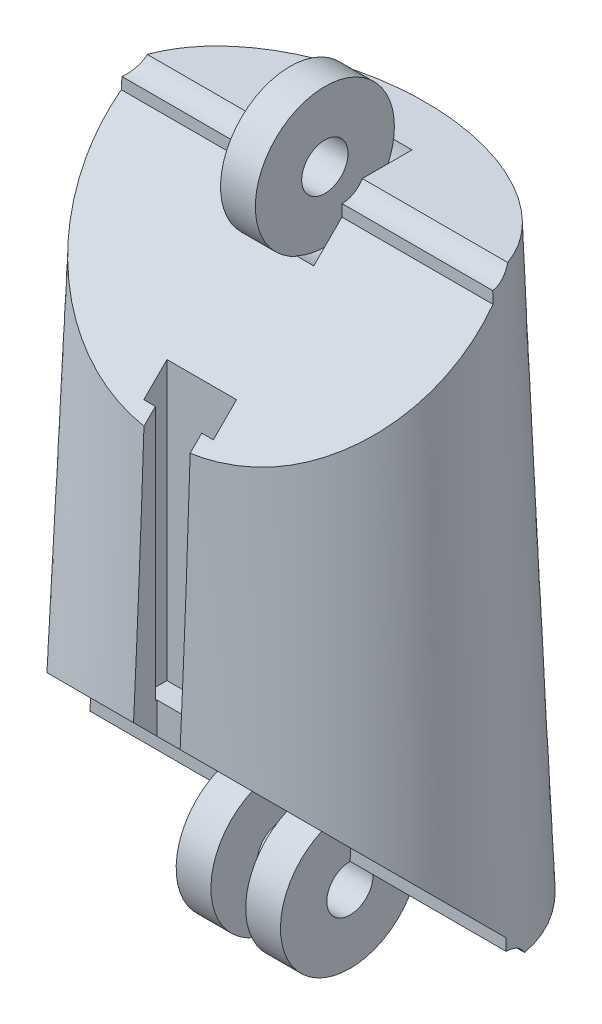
ISO-10303-21;
HEADER;
FILE_DESCRIPTION(('STEP AP214'),'2;1');
FILE_NAME('part.step','',(''),(''),'','','');
FILE_SCHEMA(('AUTOMOTIVE_DESIGN { 1 0 10303 214 1 1 1 1 }'));
ENDSEC;
DATA;
#1=APPLICATION_CONTEXT('core data for automotive mechanical design processes');
#2=APPLICATION_PROTOCOL_DEFINITION('international standard','automotive_design',2000,#1);
#3=PRODUCT_CONTEXT('',#1,'mechanical');
#4=PRODUCT('Part','Part','',(#3));
#5=PRODUCT_RELATED_PRODUCT_CATEGORY('part','',(#4));
#6=PRODUCT_DEFINITION_FORMATION('','',#4);
#7=PRODUCT_DEFINITION_CONTEXT('part definition',#1,'design');
#8=PRODUCT_DEFINITION('design','',#6,#7);
#9=PRODUCT_DEFINITION_SHAPE('','',#8);
#10=(LENGTH_UNIT() NAMED_UNIT(*) SI_UNIT(.MILLI.,.METRE.));
#11=(NAMED_UNIT(*) PLANE_ANGLE_UNIT() SI_UNIT($,.RADIAN.));
#12=(NAMED_UNIT(*) SI_UNIT($,.STERADIAN.) SOLID_ANGLE_UNIT());
#13=UNCERTAINTY_MEASURE_WITH_UNIT(LENGTH_MEASURE(1.E-05),#10,'distance_accuracy_value','');
#14=(GEOMETRIC_REPRESENTATION_CONTEXT(3) GLOBAL_UNCERTAINTY_ASSIGNED_CONTEXT((#13)) GLOBAL_UNIT_ASSIGNED_CONTEXT((#10,
#11,#12)) REPRESENTATION_CONTEXT('',''));
#15=CARTESIAN_POINT('',(0.,0.,0.));
#16=DIRECTION('',(0.,0.,1.));
#17=DIRECTION('',(1.,0.,0.));
#18=AXIS2_PLACEMENT_3D('',#15,#16,#17);
#19=CARTESIAN_POINT('',(0.75,25.4999967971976,-0.415948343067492));
#20=DIRECTION('',(-1.,0.,0.));
#21=DIRECTION('',(0.,0.,1.));
#22=AXIS2_PLACEMENT_3D('',#19,#20,#21);
#23=CYLINDRICAL_SURFACE('',#22,3.);
#24=CARTESIAN_POINT('',(0.75,25.4999967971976,-0.415948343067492));
#25=DIRECTION('',(1.,0.,0.));
#26=DIRECTION('',(0.,0.,-1.));
#27=AXIS2_PLACEMENT_3D('',#24,#25,#26);
#28=CIRCLE('',#27,3.);
#29=CARTESIAN_POINT('',(0.75,25.4999967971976,-3.41594834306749));
#30=VERTEX_POINT('',#29);
#31=EDGE_CURVE('E12',#30,#30,#28,.T.);
#32=ORIENTED_EDGE('',*,*,#31,.F.);
#33=EDGE_LOOP('',(#32));
#34=FACE_BOUND('',#33,.T.);
#35=CARTESIAN_POINT('',(-0.75,25.4999967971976,-0.415948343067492));
#36=DIRECTION('',(1.,0.,0.));
#37=DIRECTION('',(0.,0.,-1.));
#38=AXIS2_PLACEMENT_3D('',#35,#36,#37);
#39=CIRCLE('',#38,3.);
#40=CARTESIAN_POINT('',(-0.75,25.4999967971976,-3.41594834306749));
#41=VERTEX_POINT('',#40);
#42=EDGE_CURVE('E72',#41,#41,#39,.T.);
#43=ORIENTED_EDGE('',*,*,#42,.T.);
#44=EDGE_LOOP('',(#43));
#45=FACE_BOUND('',#44,.T.);
#46=ADVANCED_FACE('F65',(#34,#45),#23,.T.);
#47=CARTESIAN_POINT('',(0.75,25.4999967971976,-0.415948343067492));
#48=DIRECTION('',(1.,0.,0.));
#49=DIRECTION('',(0.,0.,-1.));
#50=AXIS2_PLACEMENT_3D('',#47,#48,#49);
#51=PLANE('',#50);
#52=CARTESIAN_POINT('',(0.750000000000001,25.4999967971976,-0.415948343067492));
#53=DIRECTION('',(1.,0.,0.));
#54=DIRECTION('',(0.,0.,-1.));
#55=AXIS2_PLACEMENT_3D('',#52,#53,#54);
#56=CIRCLE('',#55,1.);
#57=CARTESIAN_POINT('',(0.750000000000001,25.4999967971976,-1.41594834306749));
#58=VERTEX_POINT('',#57);
#59=EDGE_CURVE('E77',#58,#58,#56,.T.);
#60=ORIENTED_EDGE('',*,*,#59,.F.);
#61=EDGE_LOOP('',(#60));
#62=FACE_BOUND('',#61,.T.);
#63=ORIENTED_EDGE('',*,*,#31,.T.);
#64=EDGE_LOOP('',(#63));
#65=FACE_BOUND('',#64,.T.);
#66=ADVANCED_FACE('F94',(#62,#65),#51,.T.);
#67=CARTESIAN_POINT('',(-0.75,25.4999967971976,-0.415948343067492));
#68=DIRECTION('',(1.,0.,0.));
#69=DIRECTION('',(0.,0.,-1.));
#70=AXIS2_PLACEMENT_3D('',#67,#68,#69);
#71=PLANE('',#70);
#72=CARTESIAN_POINT('',(-0.750000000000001,25.4999967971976,-0.415948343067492));
#73=DIRECTION('',(1.,0.,0.));
#74=DIRECTION('',(0.,0.,-1.));
#75=AXIS2_PLACEMENT_3D('',#72,#73,#74);
#76=CIRCLE('',#75,1.);
#77=CARTESIAN_POINT('',(-0.750000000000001,25.4999967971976,-1.41594834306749));
#78=VERTEX_POINT('',#77);
#79=EDGE_CURVE('E68',#78,#78,#76,.T.);
#80=ORIENTED_EDGE('',*,*,#79,.T.);
#81=EDGE_LOOP('',(#80));
#82=FACE_BOUND('',#81,.T.);
#83=ORIENTED_EDGE('',*,*,#42,.F.);
#84=EDGE_LOOP('',(#83));
#85=FACE_BOUND('',#84,.T.);
#86=ADVANCED_FACE('F85',(#82,#85),#71,.F.);
#87=CARTESIAN_POINT('',(-9.00938574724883,25.4999967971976,-0.415948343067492));
#88=DIRECTION('',(1.,0.,0.));
#89=DIRECTION('',(0.,0.,-1.));
#90=AXIS2_PLACEMENT_3D('',#87,#88,#89);
#91=CYLINDRICAL_SURFACE('',#90,1.);
#92=ORIENTED_EDGE('',*,*,#59,.T.);
#93=EDGE_LOOP('',(#92));
#94=FACE_BOUND('',#93,.T.);
#95=ORIENTED_EDGE('',*,*,#79,.F.);
#96=EDGE_LOOP('',(#95));
#97=FACE_BOUND('',#96,.T.);
#98=ADVANCED_FACE('F88',(#94,#97),#91,.F.);
#99=CLOSED_SHELL('',(#46,#66,#86,#98));
#100=MANIFOLD_SOLID_BREP('B2',#99);
#101=CARTESIAN_POINT('',(0.,0.,0.));
#102=DIRECTION('',(0.,1.,0.));
#103=DIRECTION('',(0.,0.,1.));
#104=AXIS2_PLACEMENT_3D('',#101,#102,#103);
#105=PLANE('',#104);
#106=CARTESIAN_POINT('',(0.,0.,0.));
#107=DIRECTION('',(0.,1.,0.));
#108=DIRECTION('',(-1.,0.,0.));
#109=AXIS2_PLACEMENT_3D('',#106,#107,#108);
#110=ELLIPSE('',#109,9.,6.5);
#111=CARTESIAN_POINT('',(8.91973920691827,0.,-0.866029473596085));
#112=VERTEX_POINT('',#111);
#113=CARTESIAN_POINT('',(-8.9198012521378,0.,-0.866032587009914));
#114=VERTEX_POINT('',#113);
#115=EDGE_CURVE('E495',#112,#114,#110,.T.);
#116=ORIENTED_EDGE('',*,*,#115,.F.);
#117=DIRECTION('',(1.,0.,0.));
#118=VECTOR('',#117,1.);
#119=CARTESIAN_POINT('',(-9.00938574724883,0.,-0.866029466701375));
#120=LINE('',#119,#118);
#121=CARTESIAN_POINT('',(2.25,0.,-0.866029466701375));
#122=VERTEX_POINT('',#121);
#123=EDGE_CURVE('E387',#112,#122,#120,.F.);
#124=ORIENTED_EDGE('',*,*,#123,.T.);
#125=DIRECTION('',(0.,0.,-1.));
#126=VECTOR('',#125,1.);
#127=CARTESIAN_POINT('',(2.25,0.,0.));
#128=LINE('',#127,#126);
#129=CARTESIAN_POINT('',(2.25,-2.85878308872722E-08,-2.95804395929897));
#130=VERTEX_POINT('',#129);
#131=EDGE_CURVE('E421',#122,#130,#128,.T.);
#132=ORIENTED_EDGE('',*,*,#131,.T.);
#133=DIRECTION('',(1.,0.,0.));
#134=VECTOR('',#133,1.);
#135=CARTESIAN_POINT('',(-2.25,0.,-2.95804412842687));
#136=LINE('',#135,#134);
#137=CARTESIAN_POINT('',(0.75,-2.85878308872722E-08,-2.95804395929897));
#138=VERTEX_POINT('',#137);
#139=EDGE_CURVE('E428',#130,#138,#136,.F.);
#140=ORIENTED_EDGE('',*,*,#139,.T.);
#141=CARTESIAN_POINT('',(-0.75,0.,-2.95804412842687));
#142=VERTEX_POINT('',#141);
#143=EDGE_CURVE('E427',#138,#142,#136,.F.);
#144=ORIENTED_EDGE('',*,*,#143,.T.);
#145=DIRECTION('',(-1.,0.,0.));
#146=VECTOR('',#145,1.);
#147=CARTESIAN_POINT('',(-0.75,0.,-2.95804395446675));
#148=LINE('',#147,#146);
#149=CARTESIAN_POINT('',(-2.25,0.,-2.95804395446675));
#150=VERTEX_POINT('',#149);
#151=EDGE_CURVE('E409',#150,#142,#148,.F.);
#152=ORIENTED_EDGE('',*,*,#151,.F.);
#153=DIRECTION('',(0.,0.,-1.));
#154=VECTOR('',#153,1.);
#155=CARTESIAN_POINT('',(-2.25,0.,0.));
#156=LINE('',#155,#154);
#157=CARTESIAN_POINT('',(-2.25,0.,-0.866029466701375));
#158=VERTEX_POINT('',#157);
#159=EDGE_CURVE('E425',#158,#150,#156,.T.);
#160=ORIENTED_EDGE('',*,*,#159,.F.);
#161=EDGE_CURVE('E378',#158,#114,#120,.F.);
#162=ORIENTED_EDGE('',*,*,#161,.T.);
#163=EDGE_LOOP('',(#116,#124,#132,#140,#144,#152,#160,#162));
#164=FACE_BOUND('',#163,.T.);
#165=ADVANCED_FACE('F127',(#164),#105,.F.);
#166=CARTESIAN_POINT('',(10.,0.,0.));
#167=DIRECTION('',(0.,0.0167071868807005,0.999860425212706));
#168=DIRECTION('',(0.,-0.999860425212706,0.0167071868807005));
#169=AXIS2_PLACEMENT_3D('',#166,#167,#168);
#170=PLANE('',#169);
#171=DIRECTION('',(1.,0.,0.));
#172=VECTOR('',#171,1.);
#173=CARTESIAN_POINT('',(-9.00938574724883,0.499965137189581,-0.00835417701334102));
#174=LINE('',#173,#172);
#175=CARTESIAN_POINT('',(-2.25,0.499965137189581,-0.00835417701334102));
#176=VERTEX_POINT('',#175);
#177=CARTESIAN_POINT('',(-8.97995279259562,0.499965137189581,-0.00835417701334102));
#178=VERTEX_POINT('',#177);
#179=EDGE_CURVE('E376',#176,#178,#174,.F.);
#180=ORIENTED_EDGE('',*,*,#179,.F.);
#181=DIRECTION('',(0.,0.999860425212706,-0.0167071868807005));
#182=VECTOR('',#181,1.);
#183=CARTESIAN_POINT('',(-2.25,0.,0.));
#184=LINE('',#183,#182);
#185=CARTESIAN_POINT('',(-2.25,0.999860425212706,-0.0167071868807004));
#186=VERTEX_POINT('',#185);
#187=EDGE_CURVE('E423',#176,#186,#184,.T.);
#188=ORIENTED_EDGE('',*,*,#187,.T.);
#189=DIRECTION('',(-1.,0.,0.));
#190=VECTOR('',#189,1.);
#191=CARTESIAN_POINT('',(10.,0.999860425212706,-0.0167071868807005));
#192=LINE('',#191,#190);
#193=CARTESIAN_POINT('',(-8.95988107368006,0.999860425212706,-0.0167071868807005));
#194=VERTEX_POINT('',#193);
#195=EDGE_CURVE('E491',#186,#194,#192,.T.);
#196=ORIENTED_EDGE('',*,*,#195,.T.);
#197=CARTESIAN_POINT('',(-9.00001380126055,-1.40597814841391E-10,8.41930867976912E-09));
#198=CARTESIAN_POINT('',(-8.98663622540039,0.333286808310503,-0.00556905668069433));
#199=CARTESIAN_POINT('',(-8.97325864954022,0.666573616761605,-0.0111381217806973));
#200=CARTESIAN_POINT('',(-8.95988107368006,0.999860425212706,-0.0167071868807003));
#201=B_SPLINE_CURVE_WITH_KNOTS('',3,(#197,#198,#199,#200),.UNSPECIFIED.,.F.,.F.,(4,4),(0.,
1.00080499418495),.UNSPECIFIED.);
#202=EDGE_CURVE('E522',#178,#194,#201,.T.);
#203=ORIENTED_EDGE('',*,*,#202,.F.);
#204=EDGE_LOOP('',(#180,#188,#196,#203));
#205=FACE_BOUND('',#204,.T.);
#206=ADVANCED_FACE('F538',(#205),#170,.T.);
#207=CARTESIAN_POINT('',(10.,0.999860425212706,-0.0167071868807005));
#208=DIRECTION('',(0.,-0.707106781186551,0.707106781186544));
#209=DIRECTION('',(0.,-0.707106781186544,-0.707106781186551));
#210=AXIS2_PLACEMENT_3D('',#207,#208,#209);
#211=PLANE('',#210);
#212=DIRECTION('',(0.,-0.707106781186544,-0.707106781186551));
#213=VECTOR('',#212,1.);
#214=CARTESIAN_POINT('',(-0.999999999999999,0.999860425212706,-0.0167071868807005));
#215=LINE('',#214,#213);
#216=CARTESIAN_POINT('',(-1.,7.10456751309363,6.0879999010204));
#217=VERTEX_POINT('',#216);
#218=CARTESIAN_POINT('',(-1.,6.10224625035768,5.08567863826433));
#219=VERTEX_POINT('',#218);
#220=EDGE_CURVE('E368',#217,#219,#215,.T.);
#221=ORIENTED_EDGE('',*,*,#220,.F.);
#222=CARTESIAN_POINT('',(-8.95988107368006,0.999860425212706,-0.0167071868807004));
#223=CARTESIAN_POINT('',(-8.95321836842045,1.18319559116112,0.166627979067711));
#224=CARTESIAN_POINT('',(-8.93565019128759,1.36632387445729,0.349756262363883));
#225=CARTESIAN_POINT('',(-8.87882839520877,1.73091742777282,0.714349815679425));
#226=CARTESIAN_POINT('',(-8.83957154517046,1.91238244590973,0.895814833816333));
#227=CARTESIAN_POINT('',(-8.7394518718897,2.27251782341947,1.25595021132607));
#228=CARTESIAN_POINT('',(-8.67856831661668,2.45118532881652,1.43461771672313));
#229=CARTESIAN_POINT('',(-8.57118977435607,2.71587973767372,1.69931212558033));
#230=CARTESIAN_POINT('',(-8.53271726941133,2.80356769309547,1.78700008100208));
#231=CARTESIAN_POINT('',(-8.45041449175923,2.97767695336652,1.96110934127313));
#232=CARTESIAN_POINT('',(-8.40658425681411,3.06409826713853,2.04753065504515));
#233=CARTESIAN_POINT('',(-8.26783946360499,3.31998776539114,2.30342015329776));
#234=CARTESIAN_POINT('',(-8.16514293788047,3.48738204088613,2.47081442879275));
#235=CARTESIAN_POINT('',(-7.939783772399,3.81528590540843,2.79871829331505));
#236=CARTESIAN_POINT('',(-7.81712115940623,3.97579550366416,2.95922789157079));
#237=CARTESIAN_POINT('',(-7.55242284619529,4.28844149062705,3.27187387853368));
#238=CARTESIAN_POINT('',(-7.41040510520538,4.44058546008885,3.42401784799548));
#239=CARTESIAN_POINT('',(-7.10764086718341,4.73525017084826,3.71868255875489));
#240=CARTESIAN_POINT('',(-6.9468945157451,4.8777709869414,3.86120337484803));
#241=CARTESIAN_POINT('',(-6.61473813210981,5.14698317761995,4.13041556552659));
#242=CARTESIAN_POINT('',(-6.4439698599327,5.2740712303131,4.25750361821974));
#243=CARTESIAN_POINT('',(-6.08778023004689,5.51752908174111,4.50096146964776));
#244=CARTESIAN_POINT('',(-5.90235975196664,5.63389952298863,4.61733191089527));
#245=CARTESIAN_POINT('',(-5.51786910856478,5.85484193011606,4.8382743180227));
#246=CARTESIAN_POINT('',(-5.31879519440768,5.95941063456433,4.94284302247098));
#247=CARTESIAN_POINT('',(-4.90872420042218,6.15611554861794,5.13954793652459));
#248=CARTESIAN_POINT('',(-4.69772686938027,6.24825149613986,5.23168388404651));
#249=CARTESIAN_POINT('',(-4.26899049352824,6.4180888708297,5.40152125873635));
#250=CARTESIAN_POINT('',(-4.05142016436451,6.4960034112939,5.47943579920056));
#251=CARTESIAN_POINT('',(-3.60789020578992,6.63880563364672,5.62223802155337));
#252=CARTESIAN_POINT('',(-3.38193036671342,6.70369298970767,5.68712537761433));
#253=CARTESIAN_POINT('',(-2.92332361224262,6.82011171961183,5.80354410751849));
#254=CARTESIAN_POINT('',(-2.69067905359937,6.87164773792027,5.85508012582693));
#255=CARTESIAN_POINT('',(-2.22022438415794,6.96111728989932,5.94454967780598));
#256=CARTESIAN_POINT('',(-1.98241429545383,6.99905088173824,5.98248326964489));
#257=CARTESIAN_POINT('',(-1.49760987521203,7.06205697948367,6.04548936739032));
#258=CARTESIAN_POINT('',(-1.250531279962,7.08680459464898,6.07023698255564));
#259=CARTESIAN_POINT('',(-0.754313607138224,7.12198744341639,6.10541983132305));
#260=CARTESIAN_POINT('',(-0.505174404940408,7.13242180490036,6.11585419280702));
#261=CARTESIAN_POINT('',(-0.131118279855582,7.13768342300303,6.12111581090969));
#262=CARTESIAN_POINT('',(-0.00630015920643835,7.13770253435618,6.12113492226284));
#263=CARTESIAN_POINT('',(0.243246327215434,7.13424790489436,6.11768029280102));
#264=CARTESIAN_POINT('',(0.367974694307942,7.13077421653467,6.11420660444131));
#265=CARTESIAN_POINT('',(0.617132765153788,7.12034824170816,6.10378062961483));
#266=CARTESIAN_POINT('',(0.74156247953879,7.11339608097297,6.09682846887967));
#267=CARTESIAN_POINT('',(0.98994868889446,7.09608248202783,6.07951486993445));
#268=CARTESIAN_POINT('',(1.11390517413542,7.08572097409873,6.06915336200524));
#269=CARTESIAN_POINT('',(1.36814449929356,7.06091661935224,6.04434900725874));
#270=CARTESIAN_POINT('',(1.49838890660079,7.04627618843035,6.02970857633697));
#271=CARTESIAN_POINT('',(1.75790389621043,7.01318005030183,5.99661243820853));
#272=CARTESIAN_POINT('',(1.88717448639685,6.99472437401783,5.9781567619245));
#273=CARTESIAN_POINT('',(2.14453350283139,6.95403402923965,5.9374664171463));
#274=CARTESIAN_POINT('',(2.27262180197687,6.93179895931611,5.91523134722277));
#275=CARTESIAN_POINT('',(2.52743144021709,6.88370246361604,5.8671348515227));
#276=CARTESIAN_POINT('',(2.65415274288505,6.8578409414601,5.84127332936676));
#277=CARTESIAN_POINT('',(2.90593540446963,6.8025350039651,5.78596739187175));
#278=CARTESIAN_POINT('',(3.03099776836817,6.77309287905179,5.75652526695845));
#279=CARTESIAN_POINT('',(3.27927724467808,6.71055014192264,5.6939825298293));
#280=CARTESIAN_POINT('',(3.40249441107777,6.67744963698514,5.6608820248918));
#281=CARTESIAN_POINT('',(3.64685239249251,6.60760958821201,5.59104197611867));
#282=CARTESIAN_POINT('',(3.76799314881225,6.57086994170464,5.55430232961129));
#283=CARTESIAN_POINT('',(4.00795931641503,6.49378238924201,5.47721477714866));
#284=CARTESIAN_POINT('',(4.12678474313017,6.45343450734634,5.43686689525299));
#285=CARTESIAN_POINT('',(4.32453550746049,6.38256198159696,5.36599436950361));
#286=CARTESIAN_POINT('',(4.40414534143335,6.35298819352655,5.3364205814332));
#287=CARTESIAN_POINT('',(4.52263995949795,6.30743709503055,5.2908694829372));
#288=CARTESIAN_POINT('',(4.56198383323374,6.2920553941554,5.27548778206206));
#289=CARTESIAN_POINT('',(4.64030629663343,6.26083408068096,5.24426646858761));
#290=CARTESIAN_POINT('',(4.67928488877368,6.24499447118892,5.22842685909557));
#291=CARTESIAN_POINT('',(4.79563656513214,6.19678552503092,5.18021791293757));
#292=CARTESIAN_POINT('',(4.87243755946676,6.16372147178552,5.14715385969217));
#293=CARTESIAN_POINT('',(5.02441555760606,6.09578038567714,5.07921277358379));
#294=CARTESIAN_POINT('',(5.09959251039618,6.06090329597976,5.04433568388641));
#295=CARTESIAN_POINT('',(5.32255101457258,5.95362693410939,4.93705932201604));
#296=CARTESIAN_POINT('',(5.46779637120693,5.87856757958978,4.86199996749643));
#297=CARTESIAN_POINT('',(5.75085312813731,5.72191052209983,4.70534291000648));
#298=CARTESIAN_POINT('',(5.88867044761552,5.64031815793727,4.62375054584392));
#299=CARTESIAN_POINT('',(6.08964274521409,5.51337504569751,4.49680743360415));
#300=CARTESIAN_POINT('',(6.15568822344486,5.47029177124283,4.45372415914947));
#301=CARTESIAN_POINT('',(6.28585014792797,5.38269245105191,4.36612483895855));
#302=CARTESIAN_POINT('',(6.34996660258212,5.33817641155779,4.32160879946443));
#303=CARTESIAN_POINT('',(6.5393146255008,5.20254816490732,4.18598055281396));
#304=CARTESIAN_POINT('',(6.66156768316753,5.10934139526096,4.09277378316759));
#305=CARTESIAN_POINT('',(6.93406275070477,4.88794391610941,3.87137630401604));
#306=CARTESIAN_POINT('',(7.08124039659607,4.75786174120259,3.74129412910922));
#307=CARTESIAN_POINT('',(7.36035494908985,4.48983858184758,3.47327096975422));
#308=CARTESIAN_POINT('',(7.49229574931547,4.35189961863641,3.33533200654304));
#309=CARTESIAN_POINT('',(7.74022630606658,4.06884764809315,3.05228003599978));
#310=CARTESIAN_POINT('',(7.85620282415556,3.92372882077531,2.90716120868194));
#311=CARTESIAN_POINT('',(8.01761727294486,3.70153392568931,2.68496631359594));
#312=CARTESIAN_POINT('',(8.06933607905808,3.62670649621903,2.61013888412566));
#313=CARTESIAN_POINT('',(8.16858446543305,3.47567485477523,2.45910724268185));
#314=CARTESIAN_POINT('',(8.2161140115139,3.39947063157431,2.38290301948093));
#315=CARTESIAN_POINT('',(8.35697328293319,3.16099427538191,2.14442666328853));
#316=CARTESIAN_POINT('',(8.44297924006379,2.99652289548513,1.97995528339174));
#317=CARTESIAN_POINT('',(8.5955231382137,2.66312449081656,1.64655687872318));
#318=CARTESIAN_POINT('',(8.66205797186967,2.49419675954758,1.47762914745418));
#319=CARTESIAN_POINT('',(8.77540691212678,2.15340561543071,1.13683800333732));
#320=CARTESIAN_POINT('',(8.82225776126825,1.9815483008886,0.964980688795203));
#321=CARTESIAN_POINT('',(8.89617873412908,1.63579275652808,0.619225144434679));
#322=CARTESIAN_POINT('',(8.92326010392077,1.46189574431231,0.445328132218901));
#323=CARTESIAN_POINT('',(8.9451902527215,1.23965135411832,0.223083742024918));
#324=CARTESIAN_POINT('',(8.94917213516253,1.19170093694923,0.175133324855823));
#325=CARTESIAN_POINT('',(8.95564440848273,1.09579304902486,0.0792254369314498));
#326=CARTESIAN_POINT('',(8.95813613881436,1.04783562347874,0.0312680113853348));
#327=CARTESIAN_POINT('',(8.95988708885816,0.999860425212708,-0.0167071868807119));
#328=B_SPLINE_CURVE_WITH_KNOTS('',3,(#222,#223,#224,#225,#226,#227,#228,#229,#230,#231,#232,
#233,#234,#235,#236,#237,#238,#239,#240,#241,#242,#243,#244,#245,#246,#247,#248,#249,#250,#251,
#252,#253,#254,#255,#256,#257,#258,#259,#260,#261,#262,#263,#264,#265,#266,#267,#268,#269,#270,
#271,#272,#273,#274,#275,#276,#277,#278,#279,#280,#281,#282,#283,#284,#285,#286,#287,#288,#289,
#290,#291,#292,#293,#294,#295,#296,#297,#298,#299,#300,#301,#302,#303,#304,#305,#306,#307,#308,
#309,#310,#311,#312,#313,#314,#315,#316,#317,#318,#319,#320,#321,#322,#323,#324,#325,#326,#327),
.UNSPECIFIED.,.F.,.F.,(4,2,2,2,2,2,2,2,2,2,2,2,2,2,2,2,2,2,2,2,2,2,2,2,2,2,2,2,2,2,2,2,2,2,2,2,
2,2,2,2,2,2,2,2,2,2,2,2,2,2,2,2,4),(0.,0.77782819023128,1.55577228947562,2.33446417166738,
2.72387916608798,3.11329141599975,3.88639507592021,4.65949769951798,5.43188779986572,
6.20427189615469,6.94715630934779,7.68999615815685,8.43304079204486,9.17610108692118,
9.90689907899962,10.6377153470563,11.3682770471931,12.0988356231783,12.8466474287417,
13.5945047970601,13.9688821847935,14.3432539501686,14.7176121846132,15.0919780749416,
15.4875039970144,15.8830267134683,16.2785914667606,16.6741667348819,17.0694902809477,
17.4648022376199,17.8601253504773,18.2554458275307,18.5251916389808,18.660057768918,
18.7949229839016,19.0646124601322,19.3343103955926,19.8735807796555,20.4124148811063,
20.6819485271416,20.9514809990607,21.4904542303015,22.1964236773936,22.9022123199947,
23.6085827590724,23.9618567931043,24.3151337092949,25.0581737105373,25.8013322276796,
26.5430973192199,27.2844401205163,27.4882167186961,27.6918098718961),.UNSPECIFIED.);
#329=EDGE_CURVE('E548',#194,#217,#328,.T.);
#330=ORIENTED_EDGE('',*,*,#329,.F.);
#331=ORIENTED_EDGE('',*,*,#195,.F.);
#332=DIRECTION('',(0.,0.707106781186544,0.707106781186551));
#333=VECTOR('',#332,1.);
#334=CARTESIAN_POINT('',(-2.25,0.999860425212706,-0.0167071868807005));
#335=LINE('',#334,#333);
#336=CARTESIAN_POINT('',(-2.25,2.23944526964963,1.22287762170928));
#337=VERTEX_POINT('',#336);
#338=EDGE_CURVE('E639',#186,#337,#335,.T.);
#339=ORIENTED_EDGE('',*,*,#338,.T.);
#340=DIRECTION('',(-1.,0.,0.));
#341=VECTOR('',#340,1.);
#342=CARTESIAN_POINT('',(-0.75,2.23944525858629,1.22287764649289));
#343=LINE('',#342,#341);
#344=CARTESIAN_POINT('',(-0.75,2.23944526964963,1.22287762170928));
#345=VERTEX_POINT('',#344);
#346=EDGE_CURVE('E403',#337,#345,#343,.F.);
#347=ORIENTED_EDGE('',*,*,#346,.T.);
#348=DIRECTION('',(1.,0.,0.));
#349=VECTOR('',#348,1.);
#350=CARTESIAN_POINT('',(-2.25,2.23944520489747,1.22287759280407));
#351=LINE('',#350,#349);
#352=CARTESIAN_POINT('',(0.75,2.23944520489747,1.22287759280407));
#353=VERTEX_POINT('',#352);
#354=EDGE_CURVE('E636',#353,#345,#351,.F.);
#355=ORIENTED_EDGE('',*,*,#354,.F.);
#356=CARTESIAN_POINT('',(2.25,2.23944525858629,1.22287764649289));
#357=VERTEX_POINT('',#356);
#358=EDGE_CURVE('E637',#357,#353,#351,.F.);
#359=ORIENTED_EDGE('',*,*,#358,.F.);
#360=DIRECTION('',(0.,0.707106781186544,0.707106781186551));
#361=VECTOR('',#360,1.);
#362=CARTESIAN_POINT('',(2.25,0.999860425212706,-0.0167071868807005));
#363=LINE('',#362,#361);
#364=CARTESIAN_POINT('',(2.25,0.999860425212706,-0.0167071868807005));
#365=VERTEX_POINT('',#364);
#366=EDGE_CURVE('E634',#365,#357,#363,.T.);
#367=ORIENTED_EDGE('',*,*,#366,.F.);
#368=CARTESIAN_POINT('',(8.95988708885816,0.999860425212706,-0.0167071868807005));
#369=VERTEX_POINT('',#368);
#370=EDGE_CURVE('E497',#369,#365,#192,.T.);
#371=ORIENTED_EDGE('',*,*,#370,.F.);
#372=CARTESIAN_POINT('',(1.00000000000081,7.09470584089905,6.0781382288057));
#373=VERTEX_POINT('',#372);
#374=EDGE_CURVE('E555',#373,#369,#328,.T.);
#375=ORIENTED_EDGE('',*,*,#374,.F.);
#376=DIRECTION('',(0.,-0.707106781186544,-0.707106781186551));
#377=VECTOR('',#376,1.);
#378=CARTESIAN_POINT('',(0.999999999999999,0.999860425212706,-0.0167071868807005));
#379=LINE('',#378,#377);
#380=CARTESIAN_POINT('',(1.,6.10224625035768,5.08567863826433));
#381=VERTEX_POINT('',#380);
#382=EDGE_CURVE('E151',#373,#381,#379,.T.);
#383=ORIENTED_EDGE('',*,*,#382,.T.);
#384=DIRECTION('',(1.,0.,0.));
#385=VECTOR('',#384,1.);
#386=CARTESIAN_POINT('',(10.,6.10224625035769,5.08567863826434));
#387=LINE('',#386,#385);
#388=EDGE_CURVE('E370',#219,#381,#387,.T.);
#389=ORIENTED_EDGE('',*,*,#388,.F.);
#390=EDGE_LOOP('',(#221,#330,#331,#339,#347,#355,#359,#367,#371,#375,#383,#389));
#391=FACE_BOUND('',#390,.T.);
#392=ADVANCED_FACE('F539',(#391),#211,.T.);
#393=CARTESIAN_POINT('',(-7.99999146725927,25.,-0.00794024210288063));
#394=DIRECTION('',(0.,-1.,0.));
#395=DIRECTION('',(0.,0.,-1.));
#396=AXIS2_PLACEMENT_3D('',#393,#394,#395);
#397=PLANE('',#396);
#398=CARTESIAN_POINT('',(8.,25.,0.));
#399=CARTESIAN_POINT('',(8.,25.,-0.451662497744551));
#400=CARTESIAN_POINT('',(7.9183620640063,25.,-0.888728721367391));
#401=CARTESIAN_POINT('',(7.60932208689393,25.,-1.73639036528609));
#402=CARTESIAN_POINT('',(7.39014856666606,25.,-2.12538739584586));
#403=CARTESIAN_POINT('',(6.85159169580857,25.,-2.84693380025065));
#404=CARTESIAN_POINT('',(6.54248270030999,25.,-3.16585906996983));
#405=CARTESIAN_POINT('',(5.86423104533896,25.,-3.74063530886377));
#406=CARTESIAN_POINT('',(5.49181889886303,25.,-3.99717233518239));
#407=CARTESIAN_POINT('',(4.7219103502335,25.,-4.43981305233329));
#408=CARTESIAN_POINT('',(4.3217226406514,25.,-4.62856649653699));
#409=CARTESIAN_POINT('',(3.4953004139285,25.,-4.95038902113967));
#410=CARTESIAN_POINT('',(3.06594385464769,25.,-5.08393659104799));
#411=CARTESIAN_POINT('',(1.76966606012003,25.,-5.39892212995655));
#412=CARTESIAN_POINT('',(0.892980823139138,25.,-5.49962547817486));
#413=CARTESIAN_POINT('',(-0.439260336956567,25.,-5.50018574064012));
#414=CARTESIAN_POINT('',(-0.887821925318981,25.,-5.47423861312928));
#415=CARTESIAN_POINT('',(-1.76801322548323,25.,-5.37086526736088));
#416=CARTESIAN_POINT('',(-2.20235092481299,25.,-5.29364175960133));
#417=CARTESIAN_POINT('',(-3.05898007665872,25.,-5.08576896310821));
#418=CARTESIAN_POINT('',(-3.48128945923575,25.,-4.95519919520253));
#419=CARTESIAN_POINT('',(-4.31212531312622,25.,-4.63293167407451));
#420=CARTESIAN_POINT('',(-4.71888342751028,25.,-4.44132917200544));
#421=CARTESIAN_POINT('',(-5.48867512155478,25.,-3.99920212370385));
#422=CARTESIAN_POINT('',(-5.85499809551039,25.,-3.74780894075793));
#423=CARTESIAN_POINT('',(-6.5405578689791,25.,-3.168130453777));
#424=CARTESIAN_POINT('',(-6.85065942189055,25.,-2.84737836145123));
#425=CARTESIAN_POINT('',(-7.25094076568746,25.,-2.31228957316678));
#426=CARTESIAN_POINT('',(-7.37443702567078,25.,-2.12313201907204));
#427=CARTESIAN_POINT('',(-7.59134357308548,25.,-1.73091878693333));
#428=CARTESIAN_POINT('',(-7.68462626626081,25.,-1.52863913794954));
#429=CARTESIAN_POINT('',(-7.83791731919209,25.,-1.11054024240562));
#430=CARTESIAN_POINT('',(-7.89826929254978,25.,-0.892736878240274));
#431=CARTESIAN_POINT('',(-7.97910479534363,25.,-0.451221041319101));
#432=CARTESIAN_POINT('',(-7.99951447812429,25.,-0.229874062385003));
#433=CARTESIAN_POINT('',(-8.00046845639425,25.,0.213993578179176));
#434=CARTESIAN_POINT('',(-7.98077759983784,25.,0.437763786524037));
#435=CARTESIAN_POINT('',(-7.90115772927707,25.,0.881042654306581));
#436=CARTESIAN_POINT('',(-7.84224793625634,25.,1.09639973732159));
#437=CARTESIAN_POINT('',(-7.69012317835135,25.,1.51583020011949));
#438=CARTESIAN_POINT('',(-7.5960507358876,25.,1.72132975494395));
#439=CARTESIAN_POINT('',(-7.37983731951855,25.,2.11439551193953));
#440=CARTESIAN_POINT('',(-7.25853944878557,25.,2.30110033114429));
#441=CARTESIAN_POINT('',(-6.99331340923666,25.,2.65764929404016));
#442=CARTESIAN_POINT('',(-6.84936059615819,25.,2.82747507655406));
#443=CARTESIAN_POINT('',(-6.54101036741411,25.,3.15189441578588));
#444=CARTESIAN_POINT('',(-6.37663696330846,25.,3.30620051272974));
#445=CARTESIAN_POINT('',(-5.86725703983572,25.,3.73846987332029));
#446=CARTESIAN_POINT('',(-5.50251522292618,25.,3.99025218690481));
#447=CARTESIAN_POINT('',(-4.73215543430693,25.,4.43467278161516));
#448=CARTESIAN_POINT('',(-4.32446773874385,25.,4.62735466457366));
#449=CARTESIAN_POINT('',(-3.49785149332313,25.,4.94953752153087));
#450=CARTESIAN_POINT('',(-3.07593099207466,25.,5.08094816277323));
#451=CARTESIAN_POINT('',(-2.21673004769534,25.,5.2908345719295));
#452=CARTESIAN_POINT('',(-1.77848931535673,25.,5.36935852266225));
#453=CARTESIAN_POINT('',(-0.890945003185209,25.,5.47414401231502));
#454=CARTESIAN_POINT('',(-0.447823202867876,25.,5.49979336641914));
#455=CARTESIAN_POINT('',(0.437182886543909,25.,5.50020416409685));
#456=CARTESIAN_POINT('',(0.879067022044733,25.,5.47495929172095));
#457=CARTESIAN_POINT('',(1.7615575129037,25.,5.37192573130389));
#458=CARTESIAN_POINT('',(2.2041392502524,25.,5.29342087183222));
#459=CARTESIAN_POINT('',(3.06682217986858,25.,5.08365050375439));
#460=CARTESIAN_POINT('',(3.48914381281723,25.,4.9524100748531));
#461=CARTESIAN_POINT('',(4.31394897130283,25.,4.63196381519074));
#462=CARTESIAN_POINT('',(4.71866070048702,25.,4.44164359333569));
#463=CARTESIAN_POINT('',(5.49403332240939,25.,3.99593692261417));
#464=CARTESIAN_POINT('',(5.85982803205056,25.,3.74389485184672));
#465=CARTESIAN_POINT('',(6.5387045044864,25.,3.16952694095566));
#466=CARTESIAN_POINT('',(6.85406555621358,25.,2.84344806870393));
#467=CARTESIAN_POINT('',(7.25319417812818,25.,2.30896111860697));
#468=CARTESIAN_POINT('',(7.37469753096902,25.,2.12266433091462));
#469=CARTESIAN_POINT('',(7.59111553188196,25.,1.73132777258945));
#470=CARTESIAN_POINT('',(7.68601520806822,25.,1.52544662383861));
#471=CARTESIAN_POINT('',(7.83915798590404,25.,1.10655023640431));
#472=CARTESIAN_POINT('',(7.89840207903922,25.,0.892023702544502));
#473=CARTESIAN_POINT('',(7.97898535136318,25.,0.451861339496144));
#474=CARTESIAN_POINT('',(8.,25.,0.225831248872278));
#475=CARTESIAN_POINT('',(8.,25.,0.));
#476=B_SPLINE_CURVE_WITH_KNOTS('',3,(#398,#399,#400,#401,#402,#403,#404,#405,#406,#407,#408,
#409,#410,#411,#412,#413,#414,#415,#416,#417,#418,#419,#420,#421,#422,#423,#424,#425,#426,#427,
#428,#429,#430,#431,#432,#433,#434,#435,#436,#437,#438,#439,#440,#441,#442,#443,#444,#445,#446,
#447,#448,#449,#450,#451,#452,#453,#454,#455,#456,#457,#458,#459,#460,#461,#462,#463,#464,#465,
#466,#467,#468,#469,#470,#471,#472,#473,#474,#475),.UNSPECIFIED.,.T.,.F.,(4,2,2,2,2,2,2,2,2,2,2,
2,2,2,2,2,2,2,2,2,2,2,2,2,2,2,2,2,2,2,2,2,2,2,2,2,2,2,4),(0.,0.0312499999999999,
0.0624999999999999,0.0937499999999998,0.125,0.15625,0.1875,0.25,0.28125,0.3125,
0.343749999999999,0.374999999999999,0.406249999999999,0.437499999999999,0.453124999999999,
0.468749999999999,0.484374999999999,0.499999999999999,0.515624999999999,0.531249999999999,
0.546874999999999,0.562499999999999,0.578124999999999,0.593749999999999,0.624999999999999,
0.656249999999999,0.687499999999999,0.718749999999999,0.749999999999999,0.781249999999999,
0.812499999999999,0.843749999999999,0.875,0.90625,0.9375,0.953125,0.96875,0.984375,1.),.UNSPECIFIED.);
#477=CARTESIAN_POINT('',(7.77485754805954,25.,-1.28197559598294));
#478=VERTEX_POINT('',#477);
#479=CARTESIAN_POINT('',(-7.774863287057,25.,-1.28197559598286));
#480=VERTEX_POINT('',#479);
#481=EDGE_CURVE('E622',#478,#480,#476,.T.);
#482=ORIENTED_EDGE('',*,*,#481,.T.);
#483=DIRECTION('',(1.,0.,0.));
#484=VECTOR('',#483,1.);
#485=CARTESIAN_POINT('',(-9.00938574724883,25.,-1.28197559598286));
#486=LINE('',#485,#484);
#487=CARTESIAN_POINT('',(-1.5,25.,-1.28197559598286));
#488=VERTEX_POINT('',#487);
#489=EDGE_CURVE('E768',#480,#488,#486,.T.);
#490=ORIENTED_EDGE('',*,*,#489,.T.);
#491=DIRECTION('',(0.,0.,1.));
#492=VECTOR('',#491,1.);
#493=CARTESIAN_POINT('',(-1.5,25.,-0.00794024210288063));
#494=LINE('',#493,#492);
#495=CARTESIAN_POINT('',(-1.5,25.,-3.42589759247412));
#496=VERTEX_POINT('',#495);
#497=EDGE_CURVE('E485',#496,#488,#494,.T.);
#498=ORIENTED_EDGE('',*,*,#497,.F.);
#499=DIRECTION('',(1.,0.,0.));
#500=VECTOR('',#499,1.);
#501=CARTESIAN_POINT('',(-1.5,25.,-3.42589759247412));
#502=LINE('',#501,#500);
#503=CARTESIAN_POINT('',(1.5,25.,-3.42589759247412));
#504=VERTEX_POINT('',#503);
#505=EDGE_CURVE('E488',#496,#504,#502,.T.);
#506=ORIENTED_EDGE('',*,*,#505,.T.);
#507=DIRECTION('',(0.,0.,1.));
#508=VECTOR('',#507,1.);
#509=CARTESIAN_POINT('',(1.5,25.,-0.00794024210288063));
#510=LINE('',#509,#508);
#511=CARTESIAN_POINT('',(1.5,25.,-1.28197559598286));
#512=VERTEX_POINT('',#511);
#513=EDGE_CURVE('E479',#504,#512,#510,.T.);
#514=ORIENTED_EDGE('',*,*,#513,.T.);
#515=EDGE_CURVE('E435',#512,#478,#486,.T.);
#516=ORIENTED_EDGE('',*,*,#515,.T.);
#517=EDGE_LOOP('',(#482,#490,#498,#506,#514,#516));
#518=FACE_BOUND('',#517,.T.);
#519=ADVANCED_FACE('F129',(#518),#397,.F.);
#520=CARTESIAN_POINT('',(10.,24.0001395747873,-0.401030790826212));
#521=DIRECTION('',(0.,0.707106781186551,0.707106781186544));
#522=DIRECTION('',(0.,-0.707106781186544,0.707106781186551));
#523=AXIS2_PLACEMENT_3D('',#520,#521,#522);
#524=PLANE('',#523);
#525=DIRECTION('',(1.,0.,0.));
#526=VECTOR('',#525,1.);
#527=CARTESIAN_POINT('',(10.,18.4524101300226,5.14669865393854));
#528=LINE('',#527,#526);
#529=CARTESIAN_POINT('',(-1.5,18.4524101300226,5.14669865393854));
#530=VERTEX_POINT('',#529);
#531=CARTESIAN_POINT('',(-1.,18.4524101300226,5.14669865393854));
#532=VERTEX_POINT('',#531);
#533=EDGE_CURVE('E350',#530,#532,#528,.T.);
#534=ORIENTED_EDGE('',*,*,#533,.F.);
#535=DIRECTION('',(0.,0.707106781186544,-0.707106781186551));
#536=VECTOR('',#535,1.);
#537=CARTESIAN_POINT('',(-1.5,24.0001395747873,-0.401030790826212));
#538=LINE('',#537,#536);
#539=CARTESIAN_POINT('',(-1.5,19.4524101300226,4.14669865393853));
#540=VERTEX_POINT('',#539);
#541=EDGE_CURVE('E63',#530,#540,#538,.T.);
#542=ORIENTED_EDGE('',*,*,#541,.T.);
#543=DIRECTION('',(-1.,0.,0.));
#544=VECTOR('',#543,1.);
#545=CARTESIAN_POINT('',(10.,19.4524101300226,4.14669865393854));
#546=LINE('',#545,#544);
#547=CARTESIAN_POINT('',(1.5,19.4524101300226,4.14669865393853));
#548=VERTEX_POINT('',#547);
#549=EDGE_CURVE('E136',#548,#540,#546,.T.);
#550=ORIENTED_EDGE('',*,*,#549,.F.);
#551=DIRECTION('',(0.,0.707106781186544,-0.707106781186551));
#552=VECTOR('',#551,1.);
#553=CARTESIAN_POINT('',(1.5,24.0001395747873,-0.401030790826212));
#554=LINE('',#553,#552);
#555=CARTESIAN_POINT('',(1.5,18.4524101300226,5.14669865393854));
#556=VERTEX_POINT('',#555);
#557=EDGE_CURVE('E985',#556,#548,#554,.T.);
#558=ORIENTED_EDGE('',*,*,#557,.F.);
#559=CARTESIAN_POINT('',(1.,18.4524101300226,5.14669865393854));
#560=VERTEX_POINT('',#559);
#561=EDGE_CURVE('E347',#560,#556,#528,.T.);
#562=ORIENTED_EDGE('',*,*,#561,.F.);
#563=DIRECTION('',(0.,-0.707106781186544,0.707106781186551));
#564=VECTOR('',#563,1.);
#565=CARTESIAN_POINT('',(0.999999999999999,24.0001395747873,-0.401030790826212));
#566=LINE('',#565,#564);
#567=CARTESIAN_POINT('',(0.999999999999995,17.9524101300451,5.64669865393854));
#568=VERTEX_POINT('',#567);
#569=EDGE_CURVE('E361',#560,#568,#566,.T.);
#570=ORIENTED_EDGE('',*,*,#569,.T.);
#571=CARTESIAN_POINT('',(8.01846865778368,24.0001395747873,-0.401030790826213));
#572=CARTESIAN_POINT('',(8.02947372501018,23.9253573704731,-0.326248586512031));
#573=CARTESIAN_POINT('',(8.03823410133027,23.8504191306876,-0.251310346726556));
#574=CARTESIAN_POINT('',(8.05125091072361,23.7003490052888,-0.10124022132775));
#575=CARTESIAN_POINT('',(8.05550744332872,23.6252171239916,-0.0261083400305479));
#576=CARTESIAN_POINT('',(8.06149811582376,23.3997751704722,0.199333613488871));
#577=CARTESIAN_POINT('',(8.05646382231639,23.2493474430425,0.349761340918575));
#578=CARTESIAN_POINT('',(8.02858521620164,22.9497605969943,0.649348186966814));
#579=CARTESIAN_POINT('',(8.00578952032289,22.8005991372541,0.798509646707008));
#580=CARTESIAN_POINT('',(7.94274121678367,22.504102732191,1.09500605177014));
#581=CARTESIAN_POINT('',(7.90248772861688,22.3567678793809,1.24234090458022));
#582=CARTESIAN_POINT('',(7.82925827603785,22.137659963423,1.46144882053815));
#583=CARTESIAN_POINT('',(7.80264048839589,22.0647953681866,1.53431341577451));
#584=CARTESIAN_POINT('',(7.74525125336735,21.9198883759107,1.67922040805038));
#585=CARTESIAN_POINT('',(7.71447980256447,21.8478459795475,1.75126280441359));
#586=CARTESIAN_POINT('',(7.61596323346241,21.6331513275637,1.96595745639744));
#587=CARTESIAN_POINT('',(7.54200493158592,21.4918988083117,2.10720997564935));
#588=CARTESIAN_POINT('',(7.37816442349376,21.2139619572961,2.38514682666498));
#589=CARTESIAN_POINT('',(7.28826805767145,21.0772818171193,2.52182696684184));
#590=CARTESIAN_POINT('',(7.09320789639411,20.8094765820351,2.78963220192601));
#591=CARTESIAN_POINT('',(6.98804320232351,20.6783518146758,2.92075696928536));
#592=CARTESIAN_POINT('',(6.75858680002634,20.4170109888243,3.18209779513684));
#593=CARTESIAN_POINT('',(6.63367622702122,20.2870656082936,3.31204317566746));
#594=CARTESIAN_POINT('',(6.43516781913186,20.0980511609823,3.50105762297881));
#595=CARTESIAN_POINT('',(6.36713906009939,20.0360285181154,3.56308026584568));
#596=CARTESIAN_POINT('',(6.22749955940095,19.9140269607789,3.68508182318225));
#597=CARTESIAN_POINT('',(6.15588789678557,19.8540485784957,3.74506020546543));
#598=CARTESIAN_POINT('',(5.78933017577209,19.559928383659,4.03918040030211));
#599=CARTESIAN_POINT('',(5.46743007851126,19.3417912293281,4.25731755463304));
#600=CARTESIAN_POINT('',(4.94848348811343,19.0455808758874,4.55352790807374));
#601=CARTESIAN_POINT('',(4.76879712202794,18.9517384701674,4.64737031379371));
#602=CARTESIAN_POINT('',(4.49106095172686,18.8195815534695,4.77952723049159));
#603=CARTESIAN_POINT('',(4.39711449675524,18.7769637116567,4.82214507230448));
#604=CARTESIAN_POINT('',(4.20665142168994,18.6946945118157,4.90441427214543));
#605=CARTESIAN_POINT('',(4.11013465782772,18.6550433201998,4.94406546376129));
#606=CARTESIAN_POINT('',(3.9146730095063,18.5788386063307,5.02027017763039));
#607=CARTESIAN_POINT('',(3.8157278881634,18.5422853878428,5.05682339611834));
#608=CARTESIAN_POINT('',(3.61559996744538,18.4723786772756,5.12673010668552));
#609=CARTESIAN_POINT('',(3.51441722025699,18.4390251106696,5.16008367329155));
#610=CARTESIAN_POINT('',(3.36112382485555,18.3914443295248,5.20766445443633));
#611=CARTESIAN_POINT('',(3.30976734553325,18.375990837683,5.22311794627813));
#612=CARTESIAN_POINT('',(3.20661476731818,18.3458353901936,5.25327339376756));
#613=CARTESIAN_POINT('',(3.15481866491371,18.3311334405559,5.26797534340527));
#614=CARTESIAN_POINT('',(2.99879876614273,18.2881712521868,5.31093753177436));
#615=CARTESIAN_POINT('',(2.89394062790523,18.2610538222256,5.33805496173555));
#616=CARTESIAN_POINT('',(2.68665229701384,18.2108040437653,5.38830474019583));
#617=CARTESIAN_POINT('',(2.58427536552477,18.1875615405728,5.41154724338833));
#618=CARTESIAN_POINT('',(2.37832696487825,18.1439168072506,5.45519197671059));
#619=CARTESIAN_POINT('',(2.27475553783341,18.1235144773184,5.47559430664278));
#620=CARTESIAN_POINT('',(1.9625116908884,18.0665812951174,5.53252748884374));
#621=CARTESIAN_POINT('',(1.75225216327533,18.0343103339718,5.56479844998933));
#622=CARTESIAN_POINT('',(1.32878395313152,17.9811350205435,5.6179737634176));
#623=CARTESIAN_POINT('',(1.11557360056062,17.9602373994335,5.63887138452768));
#624=CARTESIAN_POINT('',(0.687528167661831,17.9297268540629,5.6693819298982));
#625=CARTESIAN_POINT('',(0.472693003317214,17.9201145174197,5.67899426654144));
#626=CARTESIAN_POINT('',(0.0201476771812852,17.9120925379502,5.68701624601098));
#627=CARTESIAN_POINT('',(-0.217609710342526,17.9149568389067,5.68415194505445));
#628=CARTESIAN_POINT('',(-0.691988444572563,17.9345425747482,5.66456620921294));
#629=CARTESIAN_POINT('',(-0.928609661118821,17.9512655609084,5.64784322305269));
#630=CARTESIAN_POINT('',(-1.39904711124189,17.9986396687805,5.60046911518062));
#631=CARTESIAN_POINT('',(-1.63286381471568,18.0292884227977,5.56982036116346));
#632=CARTESIAN_POINT('',(-1.98018400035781,18.085547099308,5.51356168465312));
#633=CARTESIAN_POINT('',(-2.09539904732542,18.1060163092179,5.49309247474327));
#634=CARTESIAN_POINT('',(-2.32449135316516,18.1504280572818,5.44868072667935));
#635=CARTESIAN_POINT('',(-2.43836862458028,18.1743705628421,5.42473822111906));
#636=CARTESIAN_POINT('',(-2.66535150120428,18.2259014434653,5.37320734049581));
#637=CARTESIAN_POINT('',(-2.77844588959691,18.2535144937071,5.34559429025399));
#638=CARTESIAN_POINT('',(-3.00282718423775,18.3121982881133,5.28691049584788));
#639=CARTESIAN_POINT('',(-3.11411407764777,18.3432690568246,5.25583972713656));
#640=CARTESIAN_POINT('',(-3.33465147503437,18.4088522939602,5.19025649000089));
#641=CARTESIAN_POINT('',(-3.44390187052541,18.4433649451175,5.15574383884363));
#642=CARTESIAN_POINT('',(-3.66011705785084,18.5157861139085,5.08332267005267));
#643=CARTESIAN_POINT('',(-3.76708185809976,18.5536946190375,5.04541416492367));
#644=CARTESIAN_POINT('',(-4.08423248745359,18.6723826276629,4.92672615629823));
#645=CARTESIAN_POINT('',(-4.29074686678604,18.7581461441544,4.84096263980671));
#646=CARTESIAN_POINT('',(-4.69211505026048,18.942317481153,4.65679130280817));
#647=CARTESIAN_POINT('',(-4.886969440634,19.0407246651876,4.5583841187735));
#648=CARTESIAN_POINT('',(-5.2544902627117,19.2446608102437,4.35444797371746));
#649=CARTESIAN_POINT('',(-5.42776965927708,19.3496352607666,4.2494735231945));
#650=CARTESIAN_POINT('',(-5.67742761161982,19.5147880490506,4.08432073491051));
#651=CARTESIAN_POINT('',(-5.75894428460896,19.5711267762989,4.02798200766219));
#652=CARTESIAN_POINT('',(-5.91844088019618,19.6862541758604,3.91285460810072));
#653=CARTESIAN_POINT('',(-5.996420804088,19.7450428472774,3.85406593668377));
#654=CARTESIAN_POINT('',(-6.2247237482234,19.9249269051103,3.67418187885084));
#655=CARTESIAN_POINT('',(-6.36948744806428,20.0495915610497,3.54951722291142));
#656=CARTESIAN_POINT('',(-6.64314136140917,20.3073185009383,3.29179028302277));
#657=CARTESIAN_POINT('',(-6.77203161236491,20.4403807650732,3.15872801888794));
#658=CARTESIAN_POINT('',(-7.00903389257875,20.7096234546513,2.88948532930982));
#659=CARTESIAN_POINT('',(-7.11767634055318,20.8455701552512,2.75353862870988));
#660=CARTESIAN_POINT('',(-7.31802284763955,21.1235644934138,2.4755442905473));
#661=CARTESIAN_POINT('',(-7.40972735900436,21.2656119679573,2.33349681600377));
#662=CARTESIAN_POINT('',(-7.57563904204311,21.5546938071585,2.04441497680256));
#663=CARTESIAN_POINT('',(-7.64984917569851,21.7017273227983,1.89738146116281));
#664=CARTESIAN_POINT('',(-7.78033081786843,21.9997224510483,1.59938633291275));
#665=CARTESIAN_POINT('',(-7.83660290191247,22.1506839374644,1.44842484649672));
#666=CARTESIAN_POINT('',(-7.92643303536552,22.442025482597,1.15708330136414));
#667=CARTESIAN_POINT('',(-7.96155627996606,22.5821649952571,1.01694378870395));
#668=CARTESIAN_POINT('',(-8.01603001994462,22.8639497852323,0.735158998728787));
#669=CARTESIAN_POINT('',(-8.03538257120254,23.0055948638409,0.593513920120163));
#670=CARTESIAN_POINT('',(-8.05811878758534,23.2896138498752,0.309494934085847));
#671=CARTESIAN_POINT('',(-8.06149452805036,23.4319880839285,0.167120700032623));
#672=CARTESIAN_POINT('',(-8.05440858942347,23.6453364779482,-0.0462276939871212));
#673=CARTESIAN_POINT('',(-8.05001918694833,23.7164340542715,-0.117325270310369));
#674=CARTESIAN_POINT('',(-8.03719064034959,23.8584481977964,-0.259339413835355));
#675=CARTESIAN_POINT('',(-8.02875138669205,23.9293647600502,-0.330255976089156));
#676=CARTESIAN_POINT('',(-8.01828912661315,24.0001395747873,-0.401030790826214));
#677=B_SPLINE_CURVE_WITH_KNOTS('',3,(#571,#572,#573,#574,#575,#576,#577,#578,#579,#580,#581,
#582,#583,#584,#585,#586,#587,#588,#589,#590,#591,#592,#593,#594,#595,#596,#597,#598,#599,#600,
#601,#602,#603,#604,#605,#606,#607,#608,#609,#610,#611,#612,#613,#614,#615,#616,#617,#618,#619,
#620,#621,#622,#623,#624,#625,#626,#627,#628,#629,#630,#631,#632,#633,#634,#635,#636,#637,#638,
#639,#640,#641,#642,#643,#644,#645,#646,#647,#648,#649,#650,#651,#652,#653,#654,#655,#656,#657,
#658,#659,#660,#661,#662,#663,#664,#665,#666,#667,#668,#669,#670,#671,#672,#673,#674,#675,#676),
.UNSPECIFIED.,.F.,.F.,(4,2,2,2,2,2,2,2,2,2,2,2,2,2,2,2,2,2,2,2,2,2,2,2,2,2,2,2,2,2,2,2,2,2,2,2,
2,2,2,2,2,2,2,2,2,2,2,2,2,2,2,2,4),(0.,0.318937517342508,0.637867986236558,1.27542559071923,
1.91124416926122,2.54709481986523,2.86630429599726,3.18551403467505,3.8237909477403,
4.46263778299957,5.10152223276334,5.76730449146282,6.10021550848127,6.43321254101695,
7.76284540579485,8.43233177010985,8.76707468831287,9.10183636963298,9.43663083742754,
9.7714175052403,9.93884597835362,10.1062757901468,10.4411264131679,10.7636162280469,
11.0860947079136,11.730869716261,12.3760259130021,13.0212157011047,13.7337444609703,
14.4463529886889,15.1588404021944,15.5151414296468,15.8714391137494,16.2302661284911,
16.5890956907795,16.947944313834,17.3067916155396,18.0242516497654,18.7416755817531,
19.4252752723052,19.7671426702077,20.1090099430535,20.7924273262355,21.4758430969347,
22.1375256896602,22.7991906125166,23.4607434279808,24.1222750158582,24.7254816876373,
25.3286097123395,25.9320368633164,26.233894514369,26.5357603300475),.UNSPECIFIED.);
#678=CARTESIAN_POINT('',(8.01846865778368,24.0001395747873,-0.401030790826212));
#679=VERTEX_POINT('',#678);
#680=EDGE_CURVE('E607',#679,#568,#677,.T.);
#681=ORIENTED_EDGE('',*,*,#680,.F.);
#682=DIRECTION('',(-1.,0.,0.));
#683=VECTOR('',#682,1.);
#684=CARTESIAN_POINT('',(10.,24.0001395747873,-0.401030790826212));
#685=LINE('',#684,#683);
#686=CARTESIAN_POINT('',(1.5,24.0001395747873,-0.401030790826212));
#687=VERTEX_POINT('',#686);
#688=EDGE_CURVE('E492',#679,#687,#685,.T.);
#689=ORIENTED_EDGE('',*,*,#688,.T.);
#690=DIRECTION('',(0.,0.707106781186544,-0.707106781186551));
#691=VECTOR('',#690,1.);
#692=CARTESIAN_POINT('',(1.5,24.0001395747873,-0.401030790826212));
#693=LINE('',#692,#691);
#694=CARTESIAN_POINT('',(1.5,22.7850190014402,0.814089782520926));
#695=VERTEX_POINT('',#694);
#696=EDGE_CURVE('E474',#695,#687,#693,.T.);
#697=ORIENTED_EDGE('',*,*,#696,.F.);
#698=DIRECTION('',(1.,0.,0.));
#699=VECTOR('',#698,1.);
#700=CARTESIAN_POINT('',(-1.5,22.7850190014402,0.814089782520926));
#701=LINE('',#700,#699);
#702=CARTESIAN_POINT('',(-1.5,22.7850190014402,0.814089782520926));
#703=VERTEX_POINT('',#702);
#704=EDGE_CURVE('E754',#703,#695,#701,.T.);
#705=ORIENTED_EDGE('',*,*,#704,.F.);
#706=DIRECTION('',(0.,0.707106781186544,-0.707106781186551));
#707=VECTOR('',#706,1.);
#708=CARTESIAN_POINT('',(-1.5,24.0001395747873,-0.401030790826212));
#709=LINE('',#708,#707);
#710=CARTESIAN_POINT('',(-1.5,24.0001395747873,-0.401030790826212));
#711=VERTEX_POINT('',#710);
#712=EDGE_CURVE('E482',#703,#711,#709,.T.);
#713=ORIENTED_EDGE('',*,*,#712,.T.);
#714=CARTESIAN_POINT('',(-8.01828912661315,24.0001395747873,-0.401030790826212));
#715=VERTEX_POINT('',#714);
#716=EDGE_CURVE('E496',#711,#715,#685,.T.);
#717=ORIENTED_EDGE('',*,*,#716,.T.);
#718=CARTESIAN_POINT('',(-1.,17.959597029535,5.63951175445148));
#719=VERTEX_POINT('',#718);
#720=EDGE_CURVE('E577',#719,#715,#677,.T.);
#721=ORIENTED_EDGE('',*,*,#720,.F.);
#722=DIRECTION('',(0.,-0.707106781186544,0.707106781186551));
#723=VECTOR('',#722,1.);
#724=CARTESIAN_POINT('',(-0.999999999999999,24.0001395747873,-0.401030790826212));
#725=LINE('',#724,#723);
#726=EDGE_CURVE('E366',#532,#719,#725,.T.);
#727=ORIENTED_EDGE('',*,*,#726,.F.);
#728=EDGE_LOOP('',(#534,#542,#550,#558,#562,#570,#681,#689,#697,#705,#713,#717,#721,#727));
#729=FACE_BOUND('',#728,.T.);
#730=ADVANCED_FACE('F598',(#729),#524,.T.);
#731=CARTESIAN_POINT('',(10.,25.,-0.417737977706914));
#732=DIRECTION('',(0.,0.0167071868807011,0.999860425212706));
#733=DIRECTION('',(0.,-0.999860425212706,0.0167071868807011));
#734=AXIS2_PLACEMENT_3D('',#731,#732,#733);
#735=PLANE('',#734);
#736=DIRECTION('',(1.,0.,0.));
#737=VECTOR('',#736,1.);
#738=CARTESIAN_POINT('',(-9.00938574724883,24.5000183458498,-0.409383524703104));
#739=LINE('',#738,#737);
#740=CARTESIAN_POINT('',(-7.99734126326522,24.5000183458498,-0.409383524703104));
#741=VERTEX_POINT('',#740);
#742=CARTESIAN_POINT('',(-1.5,24.5000183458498,-0.409383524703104));
#743=VERTEX_POINT('',#742);
#744=EDGE_CURVE('E767',#741,#743,#739,.T.);
#745=ORIENTED_EDGE('',*,*,#744,.F.);
#746=CARTESIAN_POINT('',(-8.01828912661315,24.0001395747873,-0.401030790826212));
#747=CARTESIAN_POINT('',(-8.00431406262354,24.3334263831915,-0.406599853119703));
#748=CARTESIAN_POINT('',(-7.99033899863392,24.6667131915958,-0.412168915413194));
#749=CARTESIAN_POINT('',(-7.9763639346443,25.,-0.417737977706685));
#750=B_SPLINE_CURVE_WITH_KNOTS('',3,(#746,#747,#748,#749),.UNSPECIFIED.,.F.,.F.,(4,4),(0.,
1.00087847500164),.UNSPECIFIED.);
#751=EDGE_CURVE('E568',#715,#741,#750,.T.);
#752=ORIENTED_EDGE('',*,*,#751,.F.);
#753=ORIENTED_EDGE('',*,*,#716,.F.);
#754=DIRECTION('',(0.,0.999860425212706,-0.0167071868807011));
#755=VECTOR('',#754,1.);
#756=CARTESIAN_POINT('',(-1.5,25.,-0.417737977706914));
#757=LINE('',#756,#755);
#758=EDGE_CURVE('E752',#711,#743,#757,.T.);
#759=ORIENTED_EDGE('',*,*,#758,.T.);
#760=EDGE_LOOP('',(#745,#752,#753,#759));
#761=FACE_BOUND('',#760,.T.);
#762=ADVANCED_FACE('F597',(#761),#735,.T.);
#763=CARTESIAN_POINT('',(-5.19353701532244,0.,-5.3085629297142));
#764=CARTESIAN_POINT('',(-2.67998072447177,25.,-5.17761384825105));
#765=CARTESIAN_POINT('',(-5.42464790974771,0.,-5.19062639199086));
#766=CARTESIAN_POINT('',(-3.09140327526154,25.,-5.07569613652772));
#767=CARTESIAN_POINT('',(-5.66586229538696,0.,-5.05663813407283));
#768=CARTESIAN_POINT('',(-3.49724150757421,25.,-4.94901165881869));
#769=CARTESIAN_POINT('',(-6.17118814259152,0.,-4.7387308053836));
#770=CARTESIAN_POINT('',(-4.31212531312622,25.,-4.63293167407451));
#771=CARTESIAN_POINT('',(-6.43582930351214,0.,-4.55303149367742));
#772=CARTESIAN_POINT('',(-4.71888342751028,25.,-4.44132917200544));
#773=CARTESIAN_POINT('',(-6.71372943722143,0.,-4.32888397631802));
#774=CARTESIAN_POINT('',(-5.11855927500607,25.,-4.21177680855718));
#775=CARTESIAN_POINT('',(-6.72401057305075,0.,-4.32055053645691));
#776=CARTESIAN_POINT('',(-5.1333118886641,25.,-4.20324324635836));
#777=CARTESIAN_POINT('',(-6.99185703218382,0.,-4.102366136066));
#778=CARTESIAN_POINT('',(-5.51677401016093,25.,-3.97983843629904));
#779=CARTESIAN_POINT('',(-7.25139533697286,0.,-3.86405742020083));
#780=CARTESIAN_POINT('',(-5.86816084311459,25.,-3.73667911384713));
#781=CARTESIAN_POINT('',(-7.51274484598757,0.,-3.5791200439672));
#782=CARTESIAN_POINT('',(-6.21094072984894,25.,-3.44683987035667));
#783=CARTESIAN_POINT('',(-7.52276755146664,0.,-3.56812153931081));
#784=CARTESIAN_POINT('',(-6.22405529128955,25.,-3.43566446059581));
#785=CARTESIAN_POINT('',(-7.78341703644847,0.,-3.28020821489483));
#786=CARTESIAN_POINT('',(-6.56430989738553,25.,-3.14344364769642));
#787=CARTESIAN_POINT('',(-8.02561177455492,0.,-2.96719896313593));
#788=CARTESIAN_POINT('',(-6.86090662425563,25.,-2.83368008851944));
#789=CARTESIAN_POINT('',(-8.25013932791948,0.,-2.59755922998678));
#790=CARTESIAN_POINT('',(-7.12776085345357,25.,-2.47695422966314));
#791=CARTESIAN_POINT('',(-8.25871926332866,0.,-2.58329739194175));
#792=CARTESIAN_POINT('',(-7.13794948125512,25.,-2.46319228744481));
#793=CARTESIAN_POINT('',(-8.36987651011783,0.,-2.39671001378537));
#794=CARTESIAN_POINT('',(-7.26982106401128,25.,-2.28319398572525));
#795=CARTESIAN_POINT('',(-8.46628935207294,0.,-2.21453250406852));
#796=CARTESIAN_POINT('',(-7.38276623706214,25.,-2.10807103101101));
#797=CARTESIAN_POINT('',(-8.64786920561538,0.,-1.81400267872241));
#798=CARTESIAN_POINT('',(-7.59134357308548,25.,-1.73091878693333));
#799=CARTESIAN_POINT('',(-8.73143347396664,0.,-1.59390176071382));
#800=CARTESIAN_POINT('',(-7.68462626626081,25.,-1.52863913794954));
#801=CARTESIAN_POINT('',(-8.80556933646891,0.,-1.34391636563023));
#802=CARTESIAN_POINT('',(-7.76715816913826,25.,-1.3035346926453));
#803=CARTESIAN_POINT('',(-8.81077008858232,0.,-1.32601569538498));
#804=CARTESIAN_POINT('',(-7.77294844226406,25.,-1.28742806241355));
#805=CARTESIAN_POINT('',(-8.87733523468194,0.,-1.09200695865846));
#806=CARTESIAN_POINT('',(-7.84706980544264,25.,-1.07706821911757));
#807=CARTESIAN_POINT('',(-8.92590429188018,0.,-0.86556169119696));
#808=CARTESIAN_POINT('',(-7.90137337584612,25.,-0.875782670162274));
#809=CARTESIAN_POINT('',(-8.99213150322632,0.,-0.374387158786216));
#810=CARTESIAN_POINT('',(-7.97910479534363,25.,-0.451221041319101));
#811=CARTESIAN_POINT('',(-9.00688209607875,0.,-0.108040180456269));
#812=CARTESIAN_POINT('',(-7.99951447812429,25.,-0.229874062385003));
#813=CARTESIAN_POINT('',(-8.99623950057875,0.,0.189086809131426));
#814=CARTESIAN_POINT('',(-8.0000281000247,25.,0.00910427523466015));
#815=CARTESIAN_POINT('',(-8.99533514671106,0.,0.210335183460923));
#816=CARTESIAN_POINT('',(-7.99994577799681,25.,0.026159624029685));
#817=CARTESIAN_POINT('',(-8.98163861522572,0.,0.487735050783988));
#818=CARTESIAN_POINT('',(-7.99732527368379,25.,0.248352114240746));
#819=CARTESIAN_POINT('',(-8.94740179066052,0.,0.751988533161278));
#820=CARTESIAN_POINT('',(-7.97772019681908,25.,0.454785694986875));
#821=CARTESIAN_POINT('',(-8.82377330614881,0.,1.31311409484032));
#822=CARTESIAN_POINT('',(-7.90115772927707,25.,0.881042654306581));
#823=CARTESIAN_POINT('',(-8.730030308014,0.,1.61087094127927));
#824=CARTESIAN_POINT('',(-7.84224793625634,25.,1.09639973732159));
#825=CARTESIAN_POINT('',(-8.59255225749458,0.,1.93376846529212));
#826=CARTESIAN_POINT('',(-7.76034396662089,25.,1.3222210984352));
#827=CARTESIAN_POINT('',(-8.58254686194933,0.,1.95681075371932));
#828=CARTESIAN_POINT('',(-7.75439614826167,25.,1.33830236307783));
#829=CARTESIAN_POINT('',(-8.44963610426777,0.,2.25697978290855));
#830=CARTESIAN_POINT('',(-7.67559087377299,25.,1.54734204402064));
#831=CARTESIAN_POINT('',(-8.29734289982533,0.,2.53550775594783));
#832=CARTESIAN_POINT('',(-7.5877481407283,25.,1.73642347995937));
#833=CARTESIAN_POINT('',(-7.9168185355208,0.,3.10845758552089));
#834=CARTESIAN_POINT('',(-7.37983731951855,25.,2.11439551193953));
#835=CARTESIAN_POINT('',(-7.68332410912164,0.,3.40227411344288));
#836=CARTESIAN_POINT('',(-7.25853944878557,25.,2.30110033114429));
#837=CARTESIAN_POINT('',(-7.39245714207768,0.,3.70753026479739));
#838=CARTESIAN_POINT('',(-7.11574174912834,25.,2.49306629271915));
#839=CARTESIAN_POINT('',(-7.37149576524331,0.,3.72924093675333));
#840=CARTESIAN_POINT('',(-7.10549018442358,25.,2.50670794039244));
#841=CARTESIAN_POINT('',(-7.09574234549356,0.,4.01110171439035));
#842=CARTESIAN_POINT('',(-6.9711419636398,25.,2.68368961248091));
#843=CARTESIAN_POINT('',(-6.81869322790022,0.,4.25309779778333));
#844=CARTESIAN_POINT('',(-6.83751994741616,25.,2.83993277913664));
#845=CARTESIAN_POINT('',(-6.20860975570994,0.,4.71696523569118));
#846=CARTESIAN_POINT('',(-6.54101036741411,25.,3.15189441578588));
#847=CARTESIAN_POINT('',(-5.87283533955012,0.,4.9354877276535));
#848=CARTESIAN_POINT('',(-6.37663696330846,25.,3.30620051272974));
#849=CARTESIAN_POINT('',(-5.50041482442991,0.,5.14486406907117));
#850=CARTESIAN_POINT('',(-6.19380352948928,25.,3.46135639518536));
#851=CARTESIAN_POINT('',(-5.47379340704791,0.,5.15965527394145));
#852=CARTESIAN_POINT('',(-6.18072631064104,25.,3.47236882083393));
#853=CARTESIAN_POINT('',(-4.77907828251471,0.,5.54112772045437));
#854=CARTESIAN_POINT('',(-5.83921473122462,25.,3.75776314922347));
#855=CARTESIAN_POINT('',(-4.07745113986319,0.,5.81941678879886));
#856=CARTESIAN_POINT('',(-5.48772431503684,25.,3.99878506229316));
#857=CARTESIAN_POINT('',(-3.36137114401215,0.,6.02967070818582));
#858=CARTESIAN_POINT('',(-5.10254442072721,25.,4.22099535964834));
#859=CARTESIAN_POINT('',(-3.33389447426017,0.,6.03762308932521));
#860=CARTESIAN_POINT('',(-5.08772032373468,25.,4.22948469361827));
#861=CARTESIAN_POINT('',(-2.61897525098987,0.,6.24157629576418));
#862=CARTESIAN_POINT('',(-4.70083673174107,25.,4.44942416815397));
#863=CARTESIAN_POINT('',(-1.94638485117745,0.,6.36299946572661));
#864=CARTESIAN_POINT('',(-4.30859670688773,25.,4.63354057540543));
#865=CARTESIAN_POINT('',(-1.28780497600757,0.,6.43314005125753));
#866=CARTESIAN_POINT('',(-3.89528858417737,25.,4.79463200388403));
#867=CARTESIAN_POINT('',(-1.26257817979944,0.,6.43574737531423));
#868=CARTESIAN_POINT('',(-3.87940485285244,25.,4.80077414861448));
#869=CARTESIAN_POINT('',(-0.6073029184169,0.,6.50143928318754));
#870=CARTESIAN_POINT('',(-3.46543667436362,25.,4.95959083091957));
#871=CARTESIAN_POINT('',(-0.0169149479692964,0.,6.51189543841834));
#872=CARTESIAN_POINT('',(-3.05943433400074,25.,5.08497798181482));
#873=CARTESIAN_POINT('',(0.548276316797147,0.,6.48794692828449));
#874=CARTESIAN_POINT('',(-2.62983386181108,25.,5.18992118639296));
#875=CARTESIAN_POINT('',(0.569904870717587,0.,6.48697390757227));
#876=CARTESIAN_POINT('',(-2.61332446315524,25.,5.19391204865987));
#877=CARTESIAN_POINT('',(1.13118889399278,0.,6.46027614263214));
#878=CARTESIAN_POINT('',(-2.18306500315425,25.,5.2968266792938));
#879=CARTESIAN_POINT('',(1.6242271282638,0.,6.40196461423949));
#880=CARTESIAN_POINT('',(-1.76144846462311,25.,5.37137040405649));
#881=CARTESIAN_POINT('',(2.0907287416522,0.,6.32219681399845));
#882=CARTESIAN_POINT('',(-1.31767630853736,25.,5.42376314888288));
#883=CARTESIAN_POINT('',(2.10857151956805,0.,6.31910439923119));
#884=CARTESIAN_POINT('',(-1.30063641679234,25.,5.42573559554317));
#885=CARTESIAN_POINT('',(2.57138497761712,0.,6.23783255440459));
#886=CARTESIAN_POINT('',(-0.856914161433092,25.,5.47607636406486));
#887=CARTESIAN_POINT('',(2.97235993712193,0.,6.14178988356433));
#888=CARTESIAN_POINT('',(-0.430831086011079,25.,5.49980125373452));
#889=CARTESIAN_POINT('',(3.34972839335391,0.,6.03302337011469));
#890=CARTESIAN_POINT('',(0.0116719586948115,25.,5.50000665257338));
#891=CARTESIAN_POINT('',(3.36415858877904,0.,6.02883310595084));
#892=CARTESIAN_POINT('',(0.0286631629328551,25.,5.49997701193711));
#893=CARTESIAN_POINT('',(3.73837271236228,0.,5.91937218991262));
#894=CARTESIAN_POINT('',(0.471118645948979,25.,5.49822661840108));
#895=CARTESIAN_POINT('',(4.06064568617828,0.,5.80650197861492));
#896=CARTESIAN_POINT('',(0.896010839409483,25.,5.47298104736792));
#897=CARTESIAN_POINT('',(4.65441137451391,0.,5.56967895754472));
#898=CARTESIAN_POINT('',(1.7615575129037,25.,5.37192573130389));
#899=CARTESIAN_POINT('',(4.9233623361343,0.,5.4454635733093));
#900=CARTESIAN_POINT('',(2.2041392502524,25.,5.29342087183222));
#901=CARTESIAN_POINT('',(5.17504011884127,0.,5.31798457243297));
#902=CARTESIAN_POINT('',(2.65204422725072,25.,5.18450809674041));
#903=CARTESIAN_POINT('',(5.18430796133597,0.,5.31327254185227));
#904=CARTESIAN_POINT('',(2.66859443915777,25.,5.18044164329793));
#905=CARTESIAN_POINT('',(5.42464790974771,0.,5.19062639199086));
#906=CARTESIAN_POINT('',(3.09924185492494,25.,5.07352850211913));
#907=CARTESIAN_POINT('',(5.66586229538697,0.,5.05663813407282));
#908=CARTESIAN_POINT('',(3.50498007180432,25.,4.94625750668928));
#909=CARTESIAN_POINT('',(6.17118814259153,0.,4.73873080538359));
#910=CARTESIAN_POINT('',(4.31394897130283,25.,4.63196381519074));
#911=CARTESIAN_POINT('',(6.43582930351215,0.,4.55303149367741));
#912=CARTESIAN_POINT('',(4.71866070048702,25.,4.44164359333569));
#913=CARTESIAN_POINT('',(6.71372943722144,0.,4.32888397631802));
#914=CARTESIAN_POINT('',(5.12123416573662,25.,4.21023268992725));
#915=CARTESIAN_POINT('',(6.72401057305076,0.,4.32055053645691));
#916=CARTESIAN_POINT('',(5.13608903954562,25.,4.20163208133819));
#917=CARTESIAN_POINT('',(6.99185703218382,0.,4.102366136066));
#918=CARTESIAN_POINT('',(5.52208749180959,25.,3.97652827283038));
#919=CARTESIAN_POINT('',(7.25139533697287,0.,3.86405742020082));
#920=CARTESIAN_POINT('',(5.87286246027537,25.,3.73286698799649));
#921=CARTESIAN_POINT('',(7.51274484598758,0.,3.57912004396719));
#922=CARTESIAN_POINT('',(6.21230069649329,25.,3.44568303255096));
#923=CARTESIAN_POINT('',(7.52276755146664,0.,3.5681215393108));
#924=CARTESIAN_POINT('',(6.22529962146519,25.,3.43459781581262));
#925=CARTESIAN_POINT('',(7.78341703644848,0.,3.28020821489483));
#926=CARTESIAN_POINT('',(6.56285157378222,25.,3.14443948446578));
#927=CARTESIAN_POINT('',(8.02561177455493,0.,2.96719896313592));
#928=CARTESIAN_POINT('',(6.86428324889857,25.,2.8297652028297));
#929=CARTESIAN_POINT('',(8.25013932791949,0.,2.59755922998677));
#930=CARTESIAN_POINT('',(7.13036899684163,25.,2.47344056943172));
#931=CARTESIAN_POINT('',(8.25871926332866,0.,2.58329739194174));
#932=CARTESIAN_POINT('',(7.14051862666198,25.,2.45970972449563));
#933=CARTESIAN_POINT('',(8.36987651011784,0.,2.39671001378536));
#934=CARTESIAN_POINT('',(7.27177867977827,25.,2.28029065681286));
#935=CARTESIAN_POINT('',(8.46628935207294,0.,2.21453250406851));
#936=CARTESIAN_POINT('',(7.38300798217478,25.,2.10763700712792));
#937=CARTESIAN_POINT('',(8.64786920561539,0.,1.81400267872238));
#938=CARTESIAN_POINT('',(7.59111553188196,25.,1.73132777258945));
#939=CARTESIAN_POINT('',(8.73143347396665,0.,1.59390176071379));
#940=CARTESIAN_POINT('',(7.68601520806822,25.,1.52544662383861));
#941=CARTESIAN_POINT('',(8.80556933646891,0.,1.34391636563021));
#942=CARTESIAN_POINT('',(7.76846727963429,25.,1.2999128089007));
#943=CARTESIAN_POINT('',(8.81077008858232,0.,1.32601569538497));
#944=CARTESIAN_POINT('',(7.77424576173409,25.,1.28379723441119));
#945=CARTESIAN_POINT('',(8.87733523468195,0.,1.09200695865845));
#946=CARTESIAN_POINT('',(7.84814609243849,25.,1.07356619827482));
#947=CARTESIAN_POINT('',(8.92590429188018,0.,0.865561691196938));
#948=CARTESIAN_POINT('',(7.90149647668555,25.,0.875121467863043));
#949=CARTESIAN_POINT('',(8.99213150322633,0.,0.374387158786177));
#950=CARTESIAN_POINT('',(7.97898535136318,25.,0.451861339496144));
#951=CARTESIAN_POINT('',(9.00688209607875,0.,0.108040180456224));
#952=CARTESIAN_POINT('',(8.,25.,0.225831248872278));
#953=CARTESIAN_POINT('',(8.99623950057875,0.,-0.189086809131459));
#954=CARTESIAN_POINT('',(8.,25.,-0.0173438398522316));
#955=CARTESIAN_POINT('',(8.99533514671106,0.,-0.21033518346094));
#956=CARTESIAN_POINT('',(7.99987961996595,25.,-0.0346661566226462));
#957=CARTESIAN_POINT('',(8.96794208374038,0.,-0.765134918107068));
#958=CARTESIAN_POINT('',(7.99362273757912,25.,-0.48520966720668));
#959=CARTESIAN_POINT('',(8.84789781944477,0.,-1.33403309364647));
#960=CARTESIAN_POINT('',(7.91242849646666,25.,-0.905003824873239));
#961=CARTESIAN_POINT('',(8.59255225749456,0.,-1.93376846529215));
#962=CARTESIAN_POINT('',(7.75790850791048,25.,-1.32883464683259));
#963=CARTESIAN_POINT('',(8.58254686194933,0.,-1.95681075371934));
#964=CARTESIAN_POINT('',(7.75187960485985,25.,-1.34505838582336));
#965=CARTESIAN_POINT('',(8.3167253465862,0.,-2.55714881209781));
#966=CARTESIAN_POINT('',(7.59241567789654,25.,-1.76622371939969));
#967=CARTESIAN_POINT('',(7.93270039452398,0.,-3.14056118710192));
#968=CARTESIAN_POINT('',(7.37980827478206,25.,-2.13924108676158));
#969=CARTESIAN_POINT('',(7.39245714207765,0.,-3.70753026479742));
#970=CARTESIAN_POINT('',(7.11052983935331,25.,-2.50001428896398));
#971=CARTESIAN_POINT('',(7.3714957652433,0.,-3.72924093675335));
#972=CARTESIAN_POINT('',(7.10013081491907,25.,-2.51380627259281));
#973=CARTESIAN_POINT('',(6.8199889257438,0.,-4.29296249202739));
#974=CARTESIAN_POINT('',(6.82780786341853,25.,-2.87138075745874));
#975=CARTESIAN_POINT('',(6.19213197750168,0.,-4.75597784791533));
#976=CARTESIAN_POINT('',(6.52946026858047,25.,-3.17689477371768));
#977=CARTESIAN_POINT('',(5.50041482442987,0.,-5.14486406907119));
#978=CARTESIAN_POINT('',(6.19033444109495,25.,-3.46428289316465));
#979=CARTESIAN_POINT('',(5.4737934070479,0.,-5.15965527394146));
#980=CARTESIAN_POINT('',(6.17726292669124,25.,-3.47527310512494));
#981=CARTESIAN_POINT('',(4.77907828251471,0.,-5.54112772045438));
#982=CARTESIAN_POINT('',(5.83561129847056,25.,-3.76028542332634));
#983=CARTESIAN_POINT('',(4.07745113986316,0.,-5.81941678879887));
#984=CARTESIAN_POINT('',(5.47703665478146,25.,-4.00567103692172));
#985=CARTESIAN_POINT('',(3.36137114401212,0.,-6.02967070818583));
#986=CARTESIAN_POINT('',(5.0920823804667,25.,-4.22699139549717));
#987=CARTESIAN_POINT('',(3.33389447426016,0.,-6.03762308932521));
#988=CARTESIAN_POINT('',(5.07727767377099,25.,-4.23544207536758));
#989=CARTESIAN_POINT('',(2.61897525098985,0.,-6.24157629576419));
#990=CARTESIAN_POINT('',(4.69115673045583,25.,-4.45426826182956));
#991=CARTESIAN_POINT('',(1.94638485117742,0.,-6.36299946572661));
#992=CARTESIAN_POINT('',(4.30585533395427,25.,-4.63474548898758));
#993=CARTESIAN_POINT('',(1.28780497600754,0.,-6.43314005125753));
#994=CARTESIAN_POINT('',(3.89264422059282,25.,-4.79565675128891));
#995=CARTESIAN_POINT('',(1.26257817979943,0.,-6.43574737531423));
#996=CARTESIAN_POINT('',(3.87675310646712,25.,-4.80179539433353));
#997=CARTESIAN_POINT('',(0.607302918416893,0.,-6.50143928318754));
#998=CARTESIAN_POINT('',(3.46232179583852,25.,-4.96060337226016));
#999=CARTESIAN_POINT('',(0.0169149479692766,0.,-6.51189543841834));
#1000=CARTESIAN_POINT('',(3.04935149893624,25.,-5.0879684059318));
#1001=CARTESIAN_POINT('',(-0.548276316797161,0.,-6.48794692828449));
#1002=CARTESIAN_POINT('',(2.61725890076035,25.,-5.19296358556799));
#1003=CARTESIAN_POINT('',(-0.569904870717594,0.,-6.48697390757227));
#1004=CARTESIAN_POINT('',(2.60066193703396,25.,-5.19695511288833));
#1005=CARTESIAN_POINT('',(-1.15274220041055,0.,-6.45925094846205));
#1006=CARTESIAN_POINT('',(2.15172796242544,25.,-5.30380493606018));
#1007=CARTESIAN_POINT('',(-1.66353009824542,0.,-6.39725540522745));
#1008=CARTESIAN_POINT('',(1.71627545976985,25.,-5.37942469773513));
#1009=CARTESIAN_POINT('',(-2.57138497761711,0.,-6.23783255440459));
#1010=CARTESIAN_POINT('',(0.856222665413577,25.,-5.47644670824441));
#1011=CARTESIAN_POINT('',(-2.97235993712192,0.,-6.14178988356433));
#1012=CARTESIAN_POINT('',(0.43184774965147,25.,-5.49981940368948));
#1013=CARTESIAN_POINT('',(-3.34972839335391,0.,-6.0330233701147));
#1014=CARTESIAN_POINT('',(-0.0122326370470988,25.,-5.50000615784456));
#1015=CARTESIAN_POINT('',(-3.36415858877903,0.,-6.02883310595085));
#1016=CARTESIAN_POINT('',(-0.0292919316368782,25.,-5.49997479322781));
#1017=CARTESIAN_POINT('',(-3.73837271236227,0.,-5.91937218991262));
#1018=CARTESIAN_POINT('',(-0.473697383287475,25.,-5.49815504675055));
#1019=CARTESIAN_POINT('',(-4.06064568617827,0.,-5.80650197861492));
#1020=CARTESIAN_POINT('',(-0.904721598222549,25.,-5.47225384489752));
#1021=CARTESIAN_POINT('',(-4.65441137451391,0.,-5.56967895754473));
#1022=CARTESIAN_POINT('',(-1.76801322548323,25.,-5.37086526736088));
#1023=CARTESIAN_POINT('',(-4.9233623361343,0.,-5.4454635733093));
#1024=CARTESIAN_POINT('',(-2.20235092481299,25.,-5.29364175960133));
#1025=CARTESIAN_POINT('',(-5.17504011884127,0.,-5.31798457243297));
#1026=CARTESIAN_POINT('',(-2.64711278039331,25.,-5.18571420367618));
#1027=CARTESIAN_POINT('',(-5.18430796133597,0.,-5.31327254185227));
#1028=CARTESIAN_POINT('',(-2.66355120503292,25.,-5.18168377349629));
#1029=CARTESIAN_POINT('',(-5.19353701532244,0.,-5.3085629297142));
#1030=CARTESIAN_POINT('',(-2.67998072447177,25.,-5.17761384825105));
#1031=B_SPLINE_SURFACE_WITH_KNOTS('',3,1,((#763,#764),(#765,#766),(#767,#768),(#769,#770),(#771,
#772),(#773,#774),(#775,#776),(#777,#778),(#779,#780),(#781,#782),(#783,#784),(#785,#786),(#787,
#788),(#789,#790),(#791,#792),(#793,#794),(#795,#796),(#797,#798),(#799,#800),(#801,#802),(#803,
#804),(#805,#806),(#807,#808),(#809,#810),(#811,#812),(#813,#814),(#815,#816),(#817,#818),(#819,
#820),(#821,#822),(#823,#824),(#825,#826),(#827,#828),(#829,#830),(#831,#832),(#833,#834),(#835,
#836),(#837,#838),(#839,#840),(#841,#842),(#843,#844),(#845,#846),(#847,#848),(#849,#850),(#851,
#852),(#853,#854),(#855,#856),(#857,#858),(#859,#860),(#861,#862),(#863,#864),(#865,#866),(#867,
#868),(#869,#870),(#871,#872),(#873,#874),(#875,#876),(#877,#878),(#879,#880),(#881,#882),(#883,
#884),(#885,#886),(#887,#888),(#889,#890),(#891,#892),(#893,#894),(#895,#896),(#897,#898),(#899,
#900),(#901,#902),(#903,#904),(#905,#906),(#907,#908),(#909,#910),(#911,#912),(#913,#914),(#915,
#916),(#917,#918),(#919,#920),(#921,#922),(#923,#924),(#925,#926),(#927,#928),(#929,#930),(#931,
#932),(#933,#934),(#935,#936),(#937,#938),(#939,#940),(#941,#942),(#943,#944),(#945,#946),(#947,
#948),(#949,#950),(#951,#952),(#953,#954),(#955,#956),(#957,#958),(#959,#960),(#961,#962),(#963,
#964),(#965,#966),(#967,#968),(#969,#970),(#971,#972),(#973,#974),(#975,#976),(#977,#978),(#979,
#980),(#981,#982),(#983,#984),(#985,#986),(#987,#988),(#989,#990),(#991,#992),(#993,#994),(#995,
#996),(#997,#998),(#999,#1000),(#1001,#1002),(#1003,#1004),(#1005,#1006),(#1007,#1008),(#1009,
#1010),(#1011,#1012),(#1013,#1014),(#1015,#1016),(#1017,#1018),(#1019,#1020),(#1021,#1022),
(#1023,#1024),(#1025,#1026),(#1027,#1028),(#1029,#1030)),.UNSPECIFIED.,.T.,.F.,.F.,(4,2,2,2,2,2,
2,2,2,2,2,2,2,2,2,2,2,2,2,2,2,2,2,2,2,2,2,2,2,2,2,2,2,2,2,2,2,2,2,2,2,2,2,2,2,2,2,2,2,2,2,2,2,2,
2,2,2,2,2,2,2,2,2,2,2,2,4),(2,2),(0.,0.0300500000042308,0.0613000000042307,0.0625,
0.0925500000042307,0.09375,0.123800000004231,0.125,0.139425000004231,0.155050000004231,0.15625,
0.170675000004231,0.186300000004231,0.1875,0.201925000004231,0.21755000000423,0.21875,
0.23317500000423,0.24880000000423,0.25,0.26442500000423,0.28005000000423,0.28125,
0.31130000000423,0.3125,0.34255000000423,0.34375,0.373800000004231,0.375,0.405050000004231,
0.40625,0.436300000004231,0.4375,0.467550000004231,0.498800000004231,0.5,0.530050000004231,
0.561300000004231,0.5625,0.592550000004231,0.59375,0.623800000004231,0.625,0.639425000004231,
0.655050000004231,0.65625,0.670675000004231,0.686300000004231,0.6875,0.717550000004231,0.71875,
0.748800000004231,0.75,0.780050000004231,0.78125,0.811300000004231,0.8125,0.842550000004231,
0.84375,0.873800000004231,0.875,0.90625,0.936300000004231,0.9375,0.967550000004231,
0.998800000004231,1.),(0.,1.),.UNSPECIFIED.);
#1032=CARTESIAN_POINT('',(-1.,23.7096270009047,5.48354776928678));
#1033=CARTESIAN_POINT('',(-1.,23.0417822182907,5.49834319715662));
#1034=CARTESIAN_POINT('',(-1.,22.3739613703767,5.51424021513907));
#1035=CARTESIAN_POINT('',(-1.,21.0383783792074,5.54835365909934));
#1036=CARTESIAN_POINT('',(-1.,20.3706162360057,5.56657008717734));
#1037=CARTESIAN_POINT('',(-1.,19.03519761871,5.60543753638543));
#1038=CARTESIAN_POINT('',(-0.999999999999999,18.367541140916,5.62608843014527));
#1039=CARTESIAN_POINT('',(-1.,17.0323084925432,5.66982298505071));
#1040=CARTESIAN_POINT('',(-1.,16.3647323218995,5.69290664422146));
#1041=CARTESIAN_POINT('',(-1.,15.0157019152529,5.74193751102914));
#1042=CARTESIAN_POINT('',(-1.,14.3342494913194,5.76793451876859));
#1043=CARTESIAN_POINT('',(-0.999999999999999,12.9714353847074,5.82224080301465));
#1044=CARTESIAN_POINT('',(-1.,12.2900737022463,5.85055008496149));
#1045=CARTESIAN_POINT('',(-1.,10.9274389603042,5.90927312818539));
#1046=CARTESIAN_POINT('',(-0.999999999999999,10.2461659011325,5.93968689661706));
#1047=CARTESIAN_POINT('',(-1.,8.88364952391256,6.0023614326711));
#1048=CARTESIAN_POINT('',(-1.,8.2024062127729,6.03462235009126));
#1049=CARTESIAN_POINT('',(-0.999999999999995,6.83999968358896,6.10074028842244));
#1050=CARTESIAN_POINT('',(-0.999999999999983,6.15883646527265,6.13459730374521));
#1051=CARTESIAN_POINT('',(-1.00000000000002,4.79658679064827,6.20368156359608));
#1052=CARTESIAN_POINT('',(-1.00000000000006,4.11550033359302,6.2389087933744));
#1053=CARTESIAN_POINT('',(-1.00000000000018,3.43444445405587,6.27470850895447));
#1054=B_SPLINE_CURVE_WITH_KNOTS('',3,(#1032,#1033,#1034,#1035,#1036,#1037,#1038,#1039,#1040,
#1041,#1042,#1043,#1044,#1045,#1046,#1047,#1048,#1049,#1050,#1051,#1052,#1053),.UNSPECIFIED.,
.F.,.F.,(4,2,2,2,2,2,2,2,2,2,4),(0.,2.00402575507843,4.00805332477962,6.01197609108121,
8.01589723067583,10.0617373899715,12.1075823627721,14.1534342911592,16.1994523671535,
18.2454632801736,20.2914521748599),.UNSPECIFIED.);
#1055=EDGE_CURVE('E644',#719,#217,#1054,.T.);
#1056=CARTESIAN_POINT('',(-7.77485280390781,25.,-1.28197559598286));
#1057=CARTESIAN_POINT('',(-7.78725960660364,24.949806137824,-1.25301989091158));
#1058=CARTESIAN_POINT('',(-7.80067675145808,24.9023785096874,-1.21980110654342));
#1059=CARTESIAN_POINT('',(-7.82846698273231,24.8140746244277,-1.14588953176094));
#1060=CARTESIAN_POINT('',(-7.84284003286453,24.7731981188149,-1.10519702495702));
#1061=CARTESIAN_POINT('',(-7.87147630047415,24.6990169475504,-1.01739434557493));
#1062=CARTESIAN_POINT('',(-7.88573953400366,24.6657111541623,-0.970285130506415));
#1063=CARTESIAN_POINT('',(-7.91314663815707,24.6075728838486,-0.870806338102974));
#1064=CARTESIAN_POINT('',(-7.92629075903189,24.5827385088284,-0.818437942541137));
#1065=CARTESIAN_POINT('',(-7.95048218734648,24.5424452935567,-0.709941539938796));
#1066=CARTESIAN_POINT('',(-7.96153612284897,24.5269564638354,-0.653826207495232));
#1067=CARTESIAN_POINT('',(-7.98089078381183,24.5059288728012,-0.539297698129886));
#1068=CARTESIAN_POINT('',(-7.98919231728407,24.5003871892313,-0.480885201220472));
#1069=CARTESIAN_POINT('',(-8.00224558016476,24.4996657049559,-0.366714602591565));
#1070=CARTESIAN_POINT('',(-8.00716097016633,24.5039565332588,-0.310978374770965));
#1071=CARTESIAN_POINT('',(-8.01404422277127,24.5218162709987,-0.200836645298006));
#1072=CARTESIAN_POINT('',(-8.01601299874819,24.5353823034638,-0.146430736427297));
#1073=CARTESIAN_POINT('',(-8.01722083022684,24.5707938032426,-0.0424582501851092));
#1074=CARTESIAN_POINT('',(-8.01655165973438,24.5923376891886,0.00721050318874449));
#1075=CARTESIAN_POINT('',(-8.0131139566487,24.6431218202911,0.102391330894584));
#1076=CARTESIAN_POINT('',(-8.01034434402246,24.6723660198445,0.147901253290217));
#1077=CARTESIAN_POINT('',(-8.00326227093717,24.7382058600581,0.234178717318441));
#1078=CARTESIAN_POINT('',(-7.99892755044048,24.7749040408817,0.27486596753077));
#1079=CARTESIAN_POINT('',(-7.98943481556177,24.8543325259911,0.349611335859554));
#1080=CARTESIAN_POINT('',(-7.98427826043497,24.8970521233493,0.38368097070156));
#1081=CARTESIAN_POINT('',(-7.97688281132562,24.9610611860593,0.42670762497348));
#1082=CARTESIAN_POINT('',(-7.97469384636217,24.9803403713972,0.438733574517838));
#1083=CARTESIAN_POINT('',(-7.97252010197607,25.,0.450078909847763));
#1084=B_SPLINE_CURVE_WITH_KNOTS('',3,(#1056,#1057,#1058,#1059,#1060,#1061,#1062,#1063,#1064,
#1065,#1066,#1067,#1068,#1069,#1070,#1071,#1072,#1073,#1074,#1075,#1076,#1077,#1078,#1079,#1080,
#1081,#1082,#1083),.UNSPECIFIED.,.F.,.F.,(4,2,2,2,2,2,2,2,2,2,2,2,2,4),(0.,0.177495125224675,
0.354983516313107,0.532445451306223,0.709867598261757,0.886717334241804,1.06351510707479,
1.23101931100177,1.39847158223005,1.5601504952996,1.72191259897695,1.88607238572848,
2.04994387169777,2.11837001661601),.UNSPECIFIED.);
#1085=EDGE_CURVE('E469',#480,#741,#1084,.T.);
#1086=CARTESIAN_POINT('',(7.97249864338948,25.,0.450078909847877));
#1087=CARTESIAN_POINT('',(7.97784928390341,24.9515365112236,0.422145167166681));
#1088=CARTESIAN_POINT('',(7.98328933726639,24.9054679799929,0.390084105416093));
#1089=CARTESIAN_POINT('',(7.99359065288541,24.8192456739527,0.318688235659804));
#1090=CARTESIAN_POINT('',(7.99845160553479,24.7790950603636,0.279349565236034));
#1091=CARTESIAN_POINT('',(8.00683391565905,24.7058513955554,0.194369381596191));
#1092=CARTESIAN_POINT('',(8.0103539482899,24.6727653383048,0.148721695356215));
#1093=CARTESIAN_POINT('',(8.01529911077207,24.6147024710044,0.0524621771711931));
#1094=CARTESIAN_POINT('',(8.01672572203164,24.5897199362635,0.00185388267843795));
#1095=CARTESIAN_POINT('',(8.01696084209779,24.5490202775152,-0.101809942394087));
#1096=CARTESIAN_POINT('',(8.01582072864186,24.5331291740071,-0.154797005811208));
#1097=CARTESIAN_POINT('',(8.01072263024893,24.5103004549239,-0.262542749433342));
#1098=CARTESIAN_POINT('',(8.00676440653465,24.5033635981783,-0.317301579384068));
#1099=CARTESIAN_POINT('',(7.9961172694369,24.4986039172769,-0.425751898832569));
#1100=CARTESIAN_POINT('',(7.98948865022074,24.5005890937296,-0.479441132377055));
#1101=CARTESIAN_POINT('',(7.97375319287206,24.5130218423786,-0.585444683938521));
#1102=CARTESIAN_POINT('',(7.96464646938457,24.5234690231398,-0.637759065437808));
#1103=CARTESIAN_POINT('',(7.94420506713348,24.5526877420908,-0.740812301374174));
#1104=CARTESIAN_POINT('',(7.93282639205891,24.5716347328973,-0.791492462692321));
#1105=CARTESIAN_POINT('',(7.9086409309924,24.6172671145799,-0.888900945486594));
#1106=CARTESIAN_POINT('',(7.89583312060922,24.6439580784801,-0.935626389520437));
#1107=CARTESIAN_POINT('',(7.86886056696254,24.7060201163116,-1.02651714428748));
#1108=CARTESIAN_POINT('',(7.8546599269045,24.7417867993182,-1.07040171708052));
#1109=CARTESIAN_POINT('',(7.82656992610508,24.8202053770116,-1.15151365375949));
#1110=CARTESIAN_POINT('',(7.81268010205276,24.8628461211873,-1.18875159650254));
#1111=CARTESIAN_POINT('',(7.79093333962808,24.9377778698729,-1.24374192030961));
#1112=CARTESIAN_POINT('',(7.78268888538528,24.9683500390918,-1.26371204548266));
#1113=CARTESIAN_POINT('',(7.77485754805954,25.,-1.28197559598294));
#1114=B_SPLINE_CURVE_WITH_KNOTS('',3,(#1086,#1087,#1088,#1089,#1090,#1091,#1092,#1093,#1094,
#1095,#1096,#1097,#1098,#1099,#1100,#1101,#1102,#1103,#1104,#1105,#1106,#1107,#1108,#1109,#1110,
#1111,#1112,#1113),.UNSPECIFIED.,.F.,.F.,(4,2,2,2,2,2,2,2,2,2,2,2,2,4),(0.,0.168380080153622,
0.336849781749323,0.505485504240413,0.674001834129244,0.839175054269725,1.00436227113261,
1.16601193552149,1.32765412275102,1.49279847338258,1.65806196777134,1.83238457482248,
2.0064272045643,2.11851739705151),.UNSPECIFIED.);
#1115=CARTESIAN_POINT('',(7.99750730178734,24.5000183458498,-0.409383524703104));
#1116=VERTEX_POINT('',#1115);
#1117=EDGE_CURVE('E433',#1116,#478,#1114,.T.);
#1118=CARTESIAN_POINT('',(7.97651511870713,24.9999999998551,-0.417737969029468));
#1119=CARTESIAN_POINT('',(7.99049963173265,24.6667131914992,-0.412168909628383));
#1120=CARTESIAN_POINT('',(8.00448414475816,24.3334263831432,-0.406599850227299));
#1121=CARTESIAN_POINT('',(8.01846865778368,24.0001395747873,-0.401030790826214));
#1122=B_SPLINE_CURVE_WITH_KNOTS('',3,(#1118,#1119,#1120,#1121),.UNSPECIFIED.,.F.,.F.,(4,4),(0.,
1.00087966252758),.UNSPECIFIED.);
#1123=EDGE_CURVE('E610',#1116,#679,#1122,.T.);
#1124=CARTESIAN_POINT('',(1.,23.7096270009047,5.48758131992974));
#1125=CARTESIAN_POINT('',(1.,23.041839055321,5.5041304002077));
#1126=CARTESIAN_POINT('',(1.,22.374063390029,5.52119983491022));
#1127=CARTESIAN_POINT('',(1.,21.0385460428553,5.55667809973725));
#1128=CARTESIAN_POINT('',(1.,20.3708043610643,5.57508693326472));
#1129=CARTESIAN_POINT('',(1.,19.0353996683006,5.61354168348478));
#1130=CARTESIAN_POINT('',(1.,18.3677366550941,5.63358752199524));
#1131=CARTESIAN_POINT('',(1.,17.0324710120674,5.67559625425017));
#1132=CARTESIAN_POINT('',(0.999999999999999,16.3648683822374,5.69755914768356));
#1133=CARTESIAN_POINT('',(0.999999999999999,14.6750118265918,5.75580938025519));
#1134=CARTESIAN_POINT('',(1.,13.6528059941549,5.79350701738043));
#1135=CARTESIAN_POINT('',(1.,11.6086009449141,5.8741825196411));
#1136=CARTESIAN_POINT('',(1.,10.5866017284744,5.91716039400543));
#1137=CARTESIAN_POINT('',(1.,8.54276648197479,6.00841418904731));
#1138=CARTESIAN_POINT('',(1.,7.52093046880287,6.05669048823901));
#1139=CARTESIAN_POINT('',(1.,5.98836270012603,6.13281494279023));
#1140=CARTESIAN_POINT('',(1.,5.47753793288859,6.15880808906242));
#1141=CARTESIAN_POINT('',(1.,4.45594764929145,6.21192675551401));
#1142=CARTESIAN_POINT('',(1.,3.94518213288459,6.23905227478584));
#1143=CARTESIAN_POINT('',(0.999999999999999,3.43444445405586,6.26669185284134));
#1144=B_SPLINE_CURVE_WITH_KNOTS('',3,(#1124,#1125,#1126,#1127,#1128,#1129,#1130,#1131,#1132,
#1133,#1134,#1135,#1136,#1137,#1138,#1139,#1140,#1141,#1142,#1143),.UNSPECIFIED.,.F.,.F.,(4,2,2,
2,2,2,2,2,2,4),(0.,2.0039796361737,4.00796436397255,6.01185343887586,8.01574218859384,
11.0844306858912,14.1531245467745,17.2220377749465,18.756493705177,20.2909484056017),.UNSPECIFIED.);
#1145=EDGE_CURVE('E641',#568,#373,#1144,.T.);
#1146=CARTESIAN_POINT('',(8.95988708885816,0.999860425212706,-0.0167071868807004));
#1147=CARTESIAN_POINT('',(8.97326265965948,0.666573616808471,-0.0111381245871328));
#1148=CARTESIAN_POINT('',(8.9866382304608,0.333286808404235,-0.00556906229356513));
#1149=CARTESIAN_POINT('',(9.00001380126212,0.,0.));
#1150=B_SPLINE_CURVE_WITH_KNOTS('',3,(#1146,#1147,#1148,#1149),.UNSPECIFIED.,.F.,.F.,(4,4),(0.,
1.00080475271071),.UNSPECIFIED.);
#1151=CARTESIAN_POINT('',(8.97995533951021,0.499965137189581,-0.00835417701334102));
#1152=VERTEX_POINT('',#1151);
#1153=EDGE_CURVE('E565',#369,#1152,#1150,.T.);
#1154=CARTESIAN_POINT('',(8.91962763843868,0.,-0.866029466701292));
#1155=CARTESIAN_POINT('',(8.92288007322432,0.0488650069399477,-0.837866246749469));
#1156=CARTESIAN_POINT('',(8.92676229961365,0.0952501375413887,-0.805530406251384));
#1157=CARTESIAN_POINT('',(8.93514630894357,0.18189613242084,-0.733600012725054));
#1158=CARTESIAN_POINT('',(8.93964772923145,0.222160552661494,-0.694009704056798));
#1159=CARTESIAN_POINT('',(8.94863668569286,0.29547091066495,-0.608609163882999));
#1160=CARTESIAN_POINT('',(8.9531242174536,0.328514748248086,-0.562797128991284));
#1161=CARTESIAN_POINT('',(8.96146263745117,0.386449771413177,-0.466238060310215));
#1162=CARTESIAN_POINT('',(8.96531366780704,0.411342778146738,-0.415492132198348));
#1163=CARTESIAN_POINT('',(8.97184568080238,0.452241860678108,-0.310499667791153));
#1164=CARTESIAN_POINT('',(8.97452740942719,0.468253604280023,-0.25625538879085));
#1165=CARTESIAN_POINT('',(8.97837292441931,0.490921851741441,-0.14578697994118));
#1166=CARTESIAN_POINT('',(8.97953663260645,0.497577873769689,-0.0895627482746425));
#1167=CARTESIAN_POINT('',(8.98018773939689,0.501296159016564,0.022448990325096));
#1168=CARTESIAN_POINT('',(8.97969755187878,0.498486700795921,0.0782321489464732));
#1169=CARTESIAN_POINT('',(8.9771515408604,0.483644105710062,0.188513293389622));
#1170=CARTESIAN_POINT('',(8.97509593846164,0.471612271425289,0.243011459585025));
#1171=CARTESIAN_POINT('',(8.96969781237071,0.438741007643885,0.349053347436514));
#1172=CARTESIAN_POINT('',(8.96635853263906,0.417923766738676,0.400604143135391));
#1173=CARTESIAN_POINT('',(8.95882712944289,0.368063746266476,0.499525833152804));
#1174=CARTESIAN_POINT('',(8.95463493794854,0.339020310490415,0.546896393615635));
#1175=CARTESIAN_POINT('',(8.94809821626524,0.289699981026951,0.614132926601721));
#1176=CARTESIAN_POINT('',(8.94586038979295,0.272148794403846,0.636056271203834));
#1177=CARTESIAN_POINT('',(8.94138987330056,0.235286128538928,0.678332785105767));
#1178=CARTESIAN_POINT('',(8.93915718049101,0.215976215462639,0.698687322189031));
#1179=CARTESIAN_POINT('',(8.93259088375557,0.155622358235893,0.757150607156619));
#1180=CARTESIAN_POINT('',(8.92837810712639,0.112076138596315,0.792765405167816));
#1181=CARTESIAN_POINT('',(8.92291011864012,0.044468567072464,0.839184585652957));
#1182=CARTESIAN_POINT('',(8.9212805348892,0.0224839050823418,0.853050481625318));
#1183=CARTESIAN_POINT('',(8.91978490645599,0.,0.866021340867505));
#1184=B_SPLINE_CURVE_WITH_KNOTS('',3,(#1154,#1155,#1156,#1157,#1158,#1159,#1160,#1161,#1162,
#1163,#1164,#1165,#1166,#1167,#1168,#1169,#1170,#1171,#1172,#1173,#1174,#1175,#1176,#1177,#1178,
#1179,#1180,#1181,#1182,#1183),.UNSPECIFIED.,.F.,.F.,(4,2,2,2,2,2,2,2,2,2,2,2,2,2,4),(0.,
0.169238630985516,0.338378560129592,0.507567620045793,0.676718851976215,0.84576201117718,
1.01481387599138,1.18158397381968,1.34833052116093,1.51465842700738,1.68099960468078,
1.76542980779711,1.84978554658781,2.01810448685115,2.09614309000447),.UNSPECIFIED.);
#1185=EDGE_CURVE('E392',#112,#1152,#1184,.T.);
#1186=CARTESIAN_POINT('',(-8.91962915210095,0.,0.866021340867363));
#1187=CARTESIAN_POINT('',(-8.9228804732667,0.0488649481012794,0.837858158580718));
#1188=CARTESIAN_POINT('',(-8.92676157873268,0.0952500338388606,0.805522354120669));
#1189=CARTESIAN_POINT('',(-8.93514351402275,0.181895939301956,0.733592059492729));
#1190=CARTESIAN_POINT('',(-8.93964398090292,0.22216031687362,0.694001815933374));
#1191=CARTESIAN_POINT('',(-8.94863138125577,0.295470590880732,0.608601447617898));
#1192=CARTESIAN_POINT('',(-8.95311831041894,0.328514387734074,0.562789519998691));
#1193=CARTESIAN_POINT('',(-8.96145606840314,0.386449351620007,0.466230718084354));
#1194=CARTESIAN_POINT('',(-8.96530703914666,0.411342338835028,0.415484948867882));
#1195=CARTESIAN_POINT('',(-8.97183935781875,0.452241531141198,0.310492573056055));
#1196=CARTESIAN_POINT('',(-8.97452144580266,0.468253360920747,0.25624820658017));
#1197=CARTESIAN_POINT('',(-8.97836776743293,0.49092174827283,0.145779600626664));
#1198=CARTESIAN_POINT('',(-8.97953192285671,0.497577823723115,0.089555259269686));
#1199=CARTESIAN_POINT('',(-8.98018435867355,0.501296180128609,-0.0224568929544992));
#1200=CARTESIAN_POINT('',(-8.97969504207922,0.498486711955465,-0.0782403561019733));
#1201=CARTESIAN_POINT('',(-8.97715033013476,0.483643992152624,-0.188522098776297));
#1202=CARTESIAN_POINT('',(-8.97509515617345,0.471612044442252,-0.24302055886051));
#1203=CARTESIAN_POINT('',(-8.96969743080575,0.438740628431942,-0.349062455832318));
#1204=CARTESIAN_POINT('',(-8.96635813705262,0.417923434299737,-0.400612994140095));
#1205=CARTESIAN_POINT('',(-8.95882651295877,0.368063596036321,-0.499534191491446));
#1206=CARTESIAN_POINT('',(-8.9546341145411,0.339020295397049,-0.546904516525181));
#1207=CARTESIAN_POINT('',(-8.94809717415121,0.289700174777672,-0.61414080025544));
#1208=CARTESIAN_POINT('',(-8.94585928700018,0.272149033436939,-0.636064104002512));
#1209=CARTESIAN_POINT('',(-8.941388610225,0.235286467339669,-0.678340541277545));
#1210=CARTESIAN_POINT('',(-8.93915581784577,0.215976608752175,-0.698695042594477));
#1211=CARTESIAN_POINT('',(-8.93258928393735,0.155622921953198,-0.757158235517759));
#1212=CARTESIAN_POINT('',(-8.92837643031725,0.112076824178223,-0.792772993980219));
#1213=CARTESIAN_POINT('',(-8.92290850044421,0.0444691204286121,-0.839192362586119));
#1214=CARTESIAN_POINT('',(-8.92127894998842,0.0224841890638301,-0.853058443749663));
#1215=CARTESIAN_POINT('',(-8.91978339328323,0.,-0.866029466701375));
#1216=B_SPLINE_CURVE_WITH_KNOTS('',3,(#1186,#1187,#1188,#1189,#1190,#1191,#1192,#1193,#1194,
#1195,#1196,#1197,#1198,#1199,#1200,#1201,#1202,#1203,#1204,#1205,#1206,#1207,#1208,#1209,#1210,
#1211,#1212,#1213,#1214,#1215),.UNSPECIFIED.,.F.,.F.,(4,2,2,2,2,2,2,2,2,2,2,2,2,2,4),(0.,
0.169238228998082,0.338377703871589,0.507566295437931,0.676717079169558,0.845760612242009,
1.01481285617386,1.18158383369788,1.3483312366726,1.51465838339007,1.68099880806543,
1.76542884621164,1.84978441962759,2.01810302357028,2.09614259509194),.UNSPECIFIED.);
#1217=EDGE_CURVE('E381',#178,#114,#1216,.T.);
#1218=ORIENTED_EDGE('',*,*,#1055,.F.);
#1219=ORIENTED_EDGE('',*,*,#720,.T.);
#1220=ORIENTED_EDGE('',*,*,#751,.T.);
#1221=ORIENTED_EDGE('',*,*,#1085,.F.);
#1222=ORIENTED_EDGE('',*,*,#481,.F.);
#1223=ORIENTED_EDGE('',*,*,#1117,.F.);
#1224=ORIENTED_EDGE('',*,*,#1123,.T.);
#1225=ORIENTED_EDGE('',*,*,#680,.T.);
#1226=ORIENTED_EDGE('',*,*,#1145,.T.);
#1227=ORIENTED_EDGE('',*,*,#374,.T.);
#1228=ORIENTED_EDGE('',*,*,#1153,.T.);
#1229=ORIENTED_EDGE('',*,*,#1185,.F.);
#1230=ORIENTED_EDGE('',*,*,#115,.T.);
#1231=ORIENTED_EDGE('',*,*,#1217,.F.);
#1232=ORIENTED_EDGE('',*,*,#202,.T.);
#1233=ORIENTED_EDGE('',*,*,#329,.T.);
#1234=EDGE_LOOP('',(#1218,#1219,#1220,#1221,#1222,#1223,#1224,#1225,#1226,#1227,#1228,#1229,
#1230,#1231,#1232,#1233));
#1235=FACE_BOUND('',#1234,.T.);
#1236=ADVANCED_FACE('F444',(#1235),#1031,.T.);
#1237=DIRECTION('',(1.,0.,0.));
#1238=VECTOR('',#1237,1.);
#1239=CARTESIAN_POINT('',(-9.00938574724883,0.499965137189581,-0.00835417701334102));
#1240=LINE('',#1239,#1238);
#1241=CARTESIAN_POINT('',(2.25,0.499965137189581,-0.00835417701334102));
#1242=VERTEX_POINT('',#1241);
#1243=EDGE_CURVE('E693',#1152,#1242,#1240,.F.);
#1244=ORIENTED_EDGE('',*,*,#1243,.F.);
#1245=ORIENTED_EDGE('',*,*,#1153,.F.);
#1246=ORIENTED_EDGE('',*,*,#370,.T.);
#1247=DIRECTION('',(0.,0.999860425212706,-0.0167071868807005));
#1248=VECTOR('',#1247,1.);
#1249=CARTESIAN_POINT('',(2.25,0.,0.));
#1250=LINE('',#1249,#1248);
#1251=EDGE_CURVE('E416',#1242,#365,#1250,.T.);
#1252=ORIENTED_EDGE('',*,*,#1251,.F.);
#1253=EDGE_LOOP('',(#1244,#1245,#1246,#1252));
#1254=FACE_BOUND('',#1253,.T.);
#1255=ADVANCED_FACE('F544',(#1254),#170,.T.);
#1256=DIRECTION('',(1.,0.,0.));
#1257=VECTOR('',#1256,1.);
#1258=CARTESIAN_POINT('',(-9.00938574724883,24.5000183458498,-0.409383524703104));
#1259=LINE('',#1258,#1257);
#1260=CARTESIAN_POINT('',(1.5,24.5000183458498,-0.409383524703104));
#1261=VERTEX_POINT('',#1260);
#1262=EDGE_CURVE('E431',#1261,#1116,#1259,.T.);
#1263=ORIENTED_EDGE('',*,*,#1262,.F.);
#1264=DIRECTION('',(0.,0.999860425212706,-0.0167071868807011));
#1265=VECTOR('',#1264,1.);
#1266=CARTESIAN_POINT('',(1.5,25.,-0.417737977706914));
#1267=LINE('',#1266,#1265);
#1268=EDGE_CURVE('E613',#687,#1261,#1267,.T.);
#1269=ORIENTED_EDGE('',*,*,#1268,.F.);
#1270=ORIENTED_EDGE('',*,*,#688,.F.);
#1271=ORIENTED_EDGE('',*,*,#1123,.F.);
#1272=EDGE_LOOP('',(#1263,#1269,#1270,#1271));
#1273=FACE_BOUND('',#1272,.T.);
#1274=ADVANCED_FACE('F591',(#1273),#735,.T.);
#1275=CARTESIAN_POINT('',(-1.5,25.4975235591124,-0.467440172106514));
#1276=DIRECTION('',(1.,0.,0.));
#1277=DIRECTION('',(0.,0.,-1.));
#1278=AXIS2_PLACEMENT_3D('',#1275,#1276,#1277);
#1279=CYLINDRICAL_SURFACE('',#1278,3.);
#1280=CARTESIAN_POINT('',(-1.5,25.4975235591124,-0.467440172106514));
#1281=DIRECTION('',(1.,0.,0.));
#1282=DIRECTION('',(0.,0.,-1.));
#1283=AXIS2_PLACEMENT_3D('',#1280,#1281,#1282);
#1284=CIRCLE('',#1283,3.);
#1285=EDGE_CURVE('E471',#703,#496,#1284,.T.);
#1286=ORIENTED_EDGE('',*,*,#1285,.F.);
#1287=ORIENTED_EDGE('',*,*,#704,.T.);
#1288=CARTESIAN_POINT('',(1.5,25.4975235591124,-0.467440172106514));
#1289=DIRECTION('',(1.,0.,0.));
#1290=DIRECTION('',(0.,0.,-1.));
#1291=AXIS2_PLACEMENT_3D('',#1288,#1289,#1290);
#1292=CIRCLE('',#1291,3.);
#1293=EDGE_CURVE('E475',#695,#504,#1292,.T.);
#1294=ORIENTED_EDGE('',*,*,#1293,.T.);
#1295=ORIENTED_EDGE('',*,*,#505,.F.);
#1296=EDGE_LOOP('',(#1286,#1287,#1294,#1295));
#1297=FACE_BOUND('',#1296,.T.);
#1298=ADVANCED_FACE('F595',(#1297),#1279,.F.);
#1299=CARTESIAN_POINT('',(-1.5,0.,0.));
#1300=DIRECTION('',(1.,0.,0.));
#1301=DIRECTION('',(0.,0.,-1.));
#1302=AXIS2_PLACEMENT_3D('',#1299,#1300,#1301);
#1303=PLANE('',#1302);
#1304=CARTESIAN_POINT('',(-1.5,25.4999967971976,-0.415948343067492));
#1305=DIRECTION('',(1.,0.,0.));
#1306=DIRECTION('',(0.,0.,-1.));
#1307=AXIS2_PLACEMENT_3D('',#1304,#1305,#1306);
#1308=CIRCLE('',#1307,1.);
#1309=EDGE_CURVE('E769',#743,#488,#1308,.T.);
#1310=ORIENTED_EDGE('',*,*,#1309,.F.);
#1311=ORIENTED_EDGE('',*,*,#758,.F.);
#1312=ORIENTED_EDGE('',*,*,#712,.F.);
#1313=ORIENTED_EDGE('',*,*,#1285,.T.);
#1314=ORIENTED_EDGE('',*,*,#497,.T.);
#1315=EDGE_LOOP('',(#1310,#1311,#1312,#1313,#1314));
#1316=FACE_BOUND('',#1315,.T.);
#1317=ADVANCED_FACE('F458',(#1316),#1303,.T.);
#1318=CARTESIAN_POINT('',(1.5,0.,0.));
#1319=DIRECTION('',(1.,0.,0.));
#1320=DIRECTION('',(0.,0.,-1.));
#1321=AXIS2_PLACEMENT_3D('',#1318,#1319,#1320);
#1322=PLANE('',#1321);
#1323=ORIENTED_EDGE('',*,*,#1268,.T.);
#1324=CARTESIAN_POINT('',(1.5,25.4999967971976,-0.415948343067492));
#1325=DIRECTION('',(1.,0.,0.));
#1326=DIRECTION('',(0.,0.,-1.));
#1327=AXIS2_PLACEMENT_3D('',#1324,#1325,#1326);
#1328=CIRCLE('',#1327,1.);
#1329=EDGE_CURVE('E614',#1261,#512,#1328,.T.);
#1330=ORIENTED_EDGE('',*,*,#1329,.T.);
#1331=ORIENTED_EDGE('',*,*,#513,.F.);
#1332=ORIENTED_EDGE('',*,*,#1293,.F.);
#1333=ORIENTED_EDGE('',*,*,#696,.T.);
#1334=EDGE_LOOP('',(#1323,#1330,#1331,#1332,#1333));
#1335=FACE_BOUND('',#1334,.T.);
#1336=ADVANCED_FACE('F760',(#1335),#1322,.F.);
#1337=CARTESIAN_POINT('',(-9.00938574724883,25.4999967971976,-0.415948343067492));
#1338=DIRECTION('',(1.,0.,0.));
#1339=DIRECTION('',(0.,0.,-1.));
#1340=AXIS2_PLACEMENT_3D('',#1337,#1338,#1339);
#1341=CYLINDRICAL_SURFACE('',#1340,1.);
#1342=ORIENTED_EDGE('',*,*,#1329,.F.);
#1343=ORIENTED_EDGE('',*,*,#1262,.T.);
#1344=ORIENTED_EDGE('',*,*,#1117,.T.);
#1345=ORIENTED_EDGE('',*,*,#515,.F.);
#1346=EDGE_LOOP('',(#1342,#1343,#1344,#1345));
#1347=FACE_BOUND('',#1346,.T.);
#1348=ADVANCED_FACE('F455',(#1347),#1341,.F.);
#1349=ORIENTED_EDGE('',*,*,#1085,.T.);
#1350=ORIENTED_EDGE('',*,*,#744,.T.);
#1351=ORIENTED_EDGE('',*,*,#1309,.T.);
#1352=ORIENTED_EDGE('',*,*,#489,.F.);
#1353=EDGE_LOOP('',(#1349,#1350,#1351,#1352));
#1354=FACE_BOUND('',#1353,.T.);
#1355=ADVANCED_FACE('F449',(#1354),#1341,.F.);
#1356=CARTESIAN_POINT('',(-2.25,-0.5,-4.23687705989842E-06));
#1357=DIRECTION('',(1.,0.,0.));
#1358=DIRECTION('',(0.,0.,-1.));
#1359=AXIS2_PLACEMENT_3D('',#1356,#1357,#1358);
#1360=CYLINDRICAL_SURFACE('',#1359,3.);
#1361=ORIENTED_EDGE('',*,*,#354,.T.);
#1362=CARTESIAN_POINT('',(-0.75,-0.5,-4.06291693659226E-06));
#1363=DIRECTION('',(1.,0.,0.));
#1364=DIRECTION('',(0.,0.,-1.));
#1365=AXIS2_PLACEMENT_3D('',#1362,#1363,#1364);
#1366=CIRCLE('',#1365,3.);
#1367=EDGE_CURVE('E400',#142,#345,#1366,.T.);
#1368=ORIENTED_EDGE('',*,*,#1367,.F.);
#1369=ORIENTED_EDGE('',*,*,#143,.F.);
#1370=CARTESIAN_POINT('',(0.75,-0.5,-4.06291693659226E-06));
#1371=DIRECTION('',(-1.,0.,0.));
#1372=DIRECTION('',(0.,0.,1.));
#1373=AXIS2_PLACEMENT_3D('',#1370,#1371,#1372);
#1374=CIRCLE('',#1373,3.);
#1375=EDGE_CURVE('E413',#353,#138,#1374,.T.);
#1376=ORIENTED_EDGE('',*,*,#1375,.F.);
#1377=EDGE_LOOP('',(#1361,#1368,#1369,#1376));
#1378=FACE_BOUND('',#1377,.T.);
#1379=ADVANCED_FACE('F454',(#1378),#1360,.F.);
#1380=CARTESIAN_POINT('',(2.25,-0.5,-4.06291693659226E-06));
#1381=DIRECTION('',(-1.,0.,0.));
#1382=DIRECTION('',(0.,0.,1.));
#1383=AXIS2_PLACEMENT_3D('',#1380,#1381,#1382);
#1384=PLANE('',#1383);
#1385=ORIENTED_EDGE('',*,*,#131,.F.);
#1386=CARTESIAN_POINT('',(2.25,-0.5,-4.06291693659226E-06));
#1387=DIRECTION('',(-1.,0.,0.));
#1388=DIRECTION('',(0.,0.,1.));
#1389=AXIS2_PLACEMENT_3D('',#1386,#1387,#1388);
#1390=CIRCLE('',#1389,1.);
#1391=EDGE_CURVE('E690',#122,#1242,#1390,.T.);
#1392=ORIENTED_EDGE('',*,*,#1391,.T.);
#1393=ORIENTED_EDGE('',*,*,#1251,.T.);
#1394=ORIENTED_EDGE('',*,*,#366,.T.);
#1395=CARTESIAN_POINT('',(2.25,-0.5,-4.06291693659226E-06));
#1396=DIRECTION('',(-1.,0.,0.));
#1397=DIRECTION('',(0.,0.,1.));
#1398=AXIS2_PLACEMENT_3D('',#1395,#1396,#1397);
#1399=CIRCLE('',#1398,3.);
#1400=EDGE_CURVE('E412',#130,#357,#1399,.T.);
#1401=ORIENTED_EDGE('',*,*,#1400,.F.);
#1402=EDGE_LOOP('',(#1385,#1392,#1393,#1394,#1401));
#1403=FACE_BOUND('',#1402,.T.);
#1404=ADVANCED_FACE('F709',(#1403),#1384,.F.);
#1405=CARTESIAN_POINT('',(0.75,-0.5,-4.06291693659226E-06));
#1406=DIRECTION('',(1.,0.,0.));
#1407=DIRECTION('',(0.,0.,-1.));
#1408=AXIS2_PLACEMENT_3D('',#1405,#1406,#1407);
#1409=CYLINDRICAL_SURFACE('',#1408,3.);
#1410=EDGE_CURVE('E417',#138,#353,#1374,.T.);
#1411=ORIENTED_EDGE('',*,*,#1410,.F.);
#1412=ORIENTED_EDGE('',*,*,#139,.F.);
#1413=ORIENTED_EDGE('',*,*,#1400,.T.);
#1414=ORIENTED_EDGE('',*,*,#358,.T.);
#1415=EDGE_LOOP('',(#1411,#1412,#1413,#1414));
#1416=FACE_BOUND('',#1415,.T.);
#1417=ADVANCED_FACE('F712',(#1416),#1409,.T.);
#1418=CARTESIAN_POINT('',(0.75,-0.5,-4.06291693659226E-06));
#1419=DIRECTION('',(-1.,0.,0.));
#1420=DIRECTION('',(0.,0.,1.));
#1421=AXIS2_PLACEMENT_3D('',#1418,#1419,#1420);
#1422=PLANE('',#1421);
#1423=CARTESIAN_POINT('',(0.750000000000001,-0.5,-4.06291693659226E-06));
#1424=DIRECTION('',(-1.,0.,0.));
#1425=DIRECTION('',(0.,0.,1.));
#1426=AXIS2_PLACEMENT_3D('',#1423,#1424,#1425);
#1427=CIRCLE('',#1426,1.);
#1428=CARTESIAN_POINT('',(0.750000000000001,-0.5,0.999995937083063));
#1429=VERTEX_POINT('',#1428);
#1430=EDGE_CURVE('E687',#1429,#1429,#1427,.T.);
#1431=ORIENTED_EDGE('',*,*,#1430,.F.);
#1432=EDGE_LOOP('',(#1431));
#1433=FACE_BOUND('',#1432,.T.);
#1434=ORIENTED_EDGE('',*,*,#1375,.T.);
#1435=ORIENTED_EDGE('',*,*,#1410,.T.);
#1436=EDGE_LOOP('',(#1434,#1435));
#1437=FACE_BOUND('',#1436,.T.);
#1438=ADVANCED_FACE('F866',(#1433,#1437),#1422,.T.);
#1439=CARTESIAN_POINT('',(-2.25,-0.5,-4.06291693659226E-06));
#1440=DIRECTION('',(1.,0.,0.));
#1441=DIRECTION('',(0.,0.,-1.));
#1442=AXIS2_PLACEMENT_3D('',#1439,#1440,#1441);
#1443=PLANE('',#1442);
#1444=ORIENTED_EDGE('',*,*,#187,.F.);
#1445=CARTESIAN_POINT('',(-2.25,-0.5,-4.06291693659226E-06));
#1446=DIRECTION('',(1.,0.,0.));
#1447=DIRECTION('',(0.,0.,-1.));
#1448=AXIS2_PLACEMENT_3D('',#1445,#1446,#1447);
#1449=CIRCLE('',#1448,1.);
#1450=EDGE_CURVE('E373',#176,#158,#1449,.T.);
#1451=ORIENTED_EDGE('',*,*,#1450,.T.);
#1452=ORIENTED_EDGE('',*,*,#159,.T.);
#1453=CARTESIAN_POINT('',(-2.25,-0.5,-4.06291693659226E-06));
#1454=DIRECTION('',(1.,0.,0.));
#1455=DIRECTION('',(0.,0.,-1.));
#1456=AXIS2_PLACEMENT_3D('',#1453,#1454,#1455);
#1457=CIRCLE('',#1456,3.);
#1458=EDGE_CURVE('E391',#337,#150,#1457,.T.);
#1459=ORIENTED_EDGE('',*,*,#1458,.F.);
#1460=ORIENTED_EDGE('',*,*,#338,.F.);
#1461=EDGE_LOOP('',(#1444,#1451,#1452,#1459,#1460));
#1462=FACE_BOUND('',#1461,.T.);
#1463=ADVANCED_FACE('F727',(#1462),#1443,.F.);
#1464=CARTESIAN_POINT('',(-0.75,-0.5,-4.06291693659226E-06));
#1465=DIRECTION('',(-1.,0.,0.));
#1466=DIRECTION('',(0.,0.,1.));
#1467=AXIS2_PLACEMENT_3D('',#1464,#1465,#1466);
#1468=CYLINDRICAL_SURFACE('',#1467,3.);
#1469=ORIENTED_EDGE('',*,*,#1458,.T.);
#1470=ORIENTED_EDGE('',*,*,#151,.T.);
#1471=EDGE_CURVE('E404',#345,#142,#1366,.T.);
#1472=ORIENTED_EDGE('',*,*,#1471,.F.);
#1473=ORIENTED_EDGE('',*,*,#346,.F.);
#1474=EDGE_LOOP('',(#1469,#1470,#1472,#1473));
#1475=FACE_BOUND('',#1474,.T.);
#1476=ADVANCED_FACE('F724',(#1475),#1468,.T.);
#1477=CARTESIAN_POINT('',(-0.75,-0.5,-4.06291693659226E-06));
#1478=DIRECTION('',(1.,0.,0.));
#1479=DIRECTION('',(0.,0.,-1.));
#1480=AXIS2_PLACEMENT_3D('',#1477,#1478,#1479);
#1481=PLANE('',#1480);
#1482=CARTESIAN_POINT('',(-0.750000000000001,-0.5,-4.06291693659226E-06));
#1483=DIRECTION('',(1.,0.,0.));
#1484=DIRECTION('',(0.,0.,-1.));
#1485=AXIS2_PLACEMENT_3D('',#1482,#1483,#1484);
#1486=CIRCLE('',#1485,1.);
#1487=CARTESIAN_POINT('',(-0.750000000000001,-0.5,-1.00000406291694));
#1488=VERTEX_POINT('',#1487);
#1489=EDGE_CURVE('E372',#1488,#1488,#1486,.T.);
#1490=ORIENTED_EDGE('',*,*,#1489,.F.);
#1491=EDGE_LOOP('',(#1490));
#1492=FACE_BOUND('',#1491,.T.);
#1493=ORIENTED_EDGE('',*,*,#1367,.T.);
#1494=ORIENTED_EDGE('',*,*,#1471,.T.);
#1495=EDGE_LOOP('',(#1493,#1494));
#1496=FACE_BOUND('',#1495,.T.);
#1497=ADVANCED_FACE('F677',(#1492,#1496),#1481,.T.);
#1498=CARTESIAN_POINT('',(-9.00938574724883,-0.5,-4.06291693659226E-06));
#1499=DIRECTION('',(1.,0.,0.));
#1500=DIRECTION('',(0.,0.,-1.));
#1501=AXIS2_PLACEMENT_3D('',#1498,#1499,#1500);
#1502=CYLINDRICAL_SURFACE('',#1501,1.);
#1503=ORIENTED_EDGE('',*,*,#1217,.T.);
#1504=ORIENTED_EDGE('',*,*,#161,.F.);
#1505=ORIENTED_EDGE('',*,*,#1450,.F.);
#1506=ORIENTED_EDGE('',*,*,#179,.T.);
#1507=EDGE_LOOP('',(#1503,#1504,#1505,#1506));
#1508=FACE_BOUND('',#1507,.T.);
#1509=ORIENTED_EDGE('',*,*,#1489,.T.);
#1510=EDGE_LOOP('',(#1509));
#1511=FACE_BOUND('',#1510,.T.);
#1512=ADVANCED_FACE('F673',(#1508,#1511),#1502,.F.);
#1513=ORIENTED_EDGE('',*,*,#1430,.T.);
#1514=EDGE_LOOP('',(#1513));
#1515=FACE_BOUND('',#1514,.T.);
#1516=ORIENTED_EDGE('',*,*,#1185,.T.);
#1517=ORIENTED_EDGE('',*,*,#1243,.T.);
#1518=ORIENTED_EDGE('',*,*,#1391,.F.);
#1519=ORIENTED_EDGE('',*,*,#123,.F.);
#1520=EDGE_LOOP('',(#1516,#1517,#1518,#1519));
#1521=FACE_BOUND('',#1520,.T.);
#1522=ADVANCED_FACE('F671',(#1515,#1521),#1502,.F.);
#1523=CARTESIAN_POINT('',(-1.,23.7096270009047,5.08567863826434));
#1524=DIRECTION('',(0.,0.,-1.));
#1525=DIRECTION('',(0.,1.,0.));
#1526=AXIS2_PLACEMENT_3D('',#1523,#1524,#1525);
#1527=PLANE('',#1526);
#1528=DIRECTION('',(0.,1.,0.));
#1529=VECTOR('',#1528,1.);
#1530=CARTESIAN_POINT('',(1.,23.7096270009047,5.08567863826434));
#1531=LINE('',#1530,#1529);
#1532=CARTESIAN_POINT('',(1.,7.45860186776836,5.08567863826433));
#1533=VERTEX_POINT('',#1532);
#1534=EDGE_CURVE('E357',#381,#1533,#1531,.T.);
#1535=ORIENTED_EDGE('',*,*,#1534,.T.);
#1536=DIRECTION('',(-1.,0.,0.));
#1537=VECTOR('',#1536,1.);
#1538=CARTESIAN_POINT('',(-1.,7.45860186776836,5.08567863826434));
#1539=LINE('',#1538,#1537);
#1540=CARTESIAN_POINT('',(-1.,7.45860186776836,5.08567863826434));
#1541=VERTEX_POINT('',#1540);
#1542=EDGE_CURVE('E352',#1533,#1541,#1539,.T.);
#1543=ORIENTED_EDGE('',*,*,#1542,.T.);
#1544=DIRECTION('',(0.,1.,0.));
#1545=VECTOR('',#1544,1.);
#1546=CARTESIAN_POINT('',(-1.,23.7096270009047,5.08567863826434));
#1547=LINE('',#1546,#1545);
#1548=EDGE_CURVE('E358',#219,#1541,#1547,.T.);
#1549=ORIENTED_EDGE('',*,*,#1548,.F.);
#1550=ORIENTED_EDGE('',*,*,#388,.T.);
#1551=EDGE_LOOP('',(#1535,#1543,#1549,#1550));
#1552=FACE_BOUND('',#1551,.T.);
#1553=ADVANCED_FACE('F669',(#1552),#1527,.F.);
#1554=CARTESIAN_POINT('',(-1.,0.,0.));
#1555=DIRECTION('',(-1.,0.,0.));
#1556=DIRECTION('',(0.,0.,1.));
#1557=AXIS2_PLACEMENT_3D('',#1554,#1555,#1556);
#1558=PLANE('',#1557);
#1559=ORIENTED_EDGE('',*,*,#1548,.T.);
#1560=DIRECTION('',(0.,0.,1.));
#1561=VECTOR('',#1560,1.);
#1562=CARTESIAN_POINT('',(-1.,7.45860186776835,0.));
#1563=LINE('',#1562,#1561);
#1564=CARTESIAN_POINT('',(-1.,7.45860186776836,5.14669865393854));
#1565=VERTEX_POINT('',#1564);
#1566=EDGE_CURVE('E355',#1541,#1565,#1563,.T.);
#1567=ORIENTED_EDGE('',*,*,#1566,.T.);
#1568=DIRECTION('',(0.,1.,0.));
#1569=VECTOR('',#1568,1.);
#1570=CARTESIAN_POINT('',(-1.,0.,5.14669865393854));
#1571=LINE('',#1570,#1569);
#1572=EDGE_CURVE('E330',#1565,#532,#1571,.T.);
#1573=ORIENTED_EDGE('',*,*,#1572,.T.);
#1574=ORIENTED_EDGE('',*,*,#726,.T.);
#1575=ORIENTED_EDGE('',*,*,#1055,.T.);
#1576=ORIENTED_EDGE('',*,*,#220,.T.);
#1577=EDGE_LOOP('',(#1559,#1567,#1573,#1574,#1575,#1576));
#1578=FACE_BOUND('',#1577,.T.);
#1579=ADVANCED_FACE('F666',(#1578),#1558,.F.);
#1580=CARTESIAN_POINT('',(1.,0.,0.));
#1581=DIRECTION('',(-1.,0.,0.));
#1582=DIRECTION('',(0.,0.,1.));
#1583=AXIS2_PLACEMENT_3D('',#1580,#1581,#1582);
#1584=PLANE('',#1583);
#1585=DIRECTION('',(0.,0.,1.));
#1586=VECTOR('',#1585,1.);
#1587=CARTESIAN_POINT('',(1.,7.45860186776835,0.));
#1588=LINE('',#1587,#1586);
#1589=CARTESIAN_POINT('',(1.,7.45860186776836,5.14669865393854));
#1590=VERTEX_POINT('',#1589);
#1591=EDGE_CURVE('E988',#1533,#1590,#1588,.T.);
#1592=ORIENTED_EDGE('',*,*,#1591,.F.);
#1593=ORIENTED_EDGE('',*,*,#1534,.F.);
#1594=ORIENTED_EDGE('',*,*,#382,.F.);
#1595=ORIENTED_EDGE('',*,*,#1145,.F.);
#1596=ORIENTED_EDGE('',*,*,#569,.F.);
#1597=DIRECTION('',(0.,1.,0.));
#1598=VECTOR('',#1597,1.);
#1599=CARTESIAN_POINT('',(1.,0.,5.14669865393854));
#1600=LINE('',#1599,#1598);
#1601=EDGE_CURVE('E648',#1590,#560,#1600,.T.);
#1602=ORIENTED_EDGE('',*,*,#1601,.F.);
#1603=EDGE_LOOP('',(#1592,#1593,#1594,#1595,#1596,#1602));
#1604=FACE_BOUND('',#1603,.T.);
#1605=ADVANCED_FACE('F662',(#1604),#1584,.T.);
#1606=CARTESIAN_POINT('',(-1.5,7.45860186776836,5.14669865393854));
#1607=DIRECTION('',(0.,-1.,0.));
#1608=DIRECTION('',(0.,0.,-1.));
#1609=AXIS2_PLACEMENT_3D('',#1606,#1607,#1608);
#1610=PLANE('',#1609);
#1611=ORIENTED_EDGE('',*,*,#1542,.F.);
#1612=ORIENTED_EDGE('',*,*,#1591,.T.);
#1613=DIRECTION('',(1.,0.,0.));
#1614=VECTOR('',#1613,1.);
#1615=CARTESIAN_POINT('',(-1.5,7.45860186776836,5.14669865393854));
#1616=LINE('',#1615,#1614);
#1617=CARTESIAN_POINT('',(1.5,7.45860186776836,5.14669865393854));
#1618=VERTEX_POINT('',#1617);
#1619=EDGE_CURVE('E143',#1590,#1618,#1616,.T.);
#1620=ORIENTED_EDGE('',*,*,#1619,.T.);
#1621=DIRECTION('',(0.,0.,-1.));
#1622=VECTOR('',#1621,1.);
#1623=CARTESIAN_POINT('',(1.5,7.45860186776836,5.14669865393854));
#1624=LINE('',#1623,#1622);
#1625=CARTESIAN_POINT('',(1.5,7.45860186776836,4.14669865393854));
#1626=VERTEX_POINT('',#1625);
#1627=EDGE_CURVE('E343',#1618,#1626,#1624,.T.);
#1628=ORIENTED_EDGE('',*,*,#1627,.T.);
#1629=DIRECTION('',(1.,0.,0.));
#1630=VECTOR('',#1629,1.);
#1631=CARTESIAN_POINT('',(-1.5,7.45860186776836,4.14669865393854));
#1632=LINE('',#1631,#1630);
#1633=CARTESIAN_POINT('',(-1.5,7.45860186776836,4.14669865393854));
#1634=VERTEX_POINT('',#1633);
#1635=EDGE_CURVE('E333',#1634,#1626,#1632,.T.);
#1636=ORIENTED_EDGE('',*,*,#1635,.F.);
#1637=DIRECTION('',(0.,0.,-1.));
#1638=VECTOR('',#1637,1.);
#1639=CARTESIAN_POINT('',(-1.5,7.45860186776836,5.14669865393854));
#1640=LINE('',#1639,#1638);
#1641=CARTESIAN_POINT('',(-1.5,7.45860186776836,5.14669865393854));
#1642=VERTEX_POINT('',#1641);
#1643=EDGE_CURVE('E320',#1642,#1634,#1640,.T.);
#1644=ORIENTED_EDGE('',*,*,#1643,.F.);
#1645=EDGE_CURVE('E327',#1642,#1565,#1616,.T.);
#1646=ORIENTED_EDGE('',*,*,#1645,.T.);
#1647=ORIENTED_EDGE('',*,*,#1566,.F.);
#1648=EDGE_LOOP('',(#1611,#1612,#1620,#1628,#1636,#1644,#1646,#1647));
#1649=FACE_BOUND('',#1648,.T.);
#1650=ADVANCED_FACE('F335',(#1649),#1610,.F.);
#1651=CARTESIAN_POINT('',(-1.5,24.265356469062,5.14669865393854));
#1652=DIRECTION('',(0.,0.,1.));
#1653=DIRECTION('',(1.,0.,0.));
#1654=AXIS2_PLACEMENT_3D('',#1651,#1652,#1653);
#1655=PLANE('',#1654);
#1656=ORIENTED_EDGE('',*,*,#533,.T.);
#1657=ORIENTED_EDGE('',*,*,#1572,.F.);
#1658=ORIENTED_EDGE('',*,*,#1645,.F.);
#1659=DIRECTION('',(0.,-1.,0.));
#1660=VECTOR('',#1659,1.);
#1661=CARTESIAN_POINT('',(-1.5,24.265356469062,5.14669865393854));
#1662=LINE('',#1661,#1660);
#1663=EDGE_CURVE('E315',#530,#1642,#1662,.T.);
#1664=ORIENTED_EDGE('',*,*,#1663,.F.);
#1665=EDGE_LOOP('',(#1656,#1657,#1658,#1664));
#1666=FACE_BOUND('',#1665,.T.);
#1667=ADVANCED_FACE('F328',(#1666),#1655,.F.);
#1668=CARTESIAN_POINT('',(-1.5,7.45860186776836,4.14669865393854));
#1669=DIRECTION('',(0.,0.,-1.));
#1670=DIRECTION('',(-1.,0.,0.));
#1671=AXIS2_PLACEMENT_3D('',#1668,#1669,#1670);
#1672=PLANE('',#1671);
#1673=ORIENTED_EDGE('',*,*,#549,.T.);
#1674=DIRECTION('',(0.,1.,0.));
#1675=VECTOR('',#1674,1.);
#1676=CARTESIAN_POINT('',(-1.5,7.45860186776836,4.14669865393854));
#1677=LINE('',#1676,#1675);
#1678=EDGE_CURVE('E337',#1634,#540,#1677,.T.);
#1679=ORIENTED_EDGE('',*,*,#1678,.F.);
#1680=ORIENTED_EDGE('',*,*,#1635,.T.);
#1681=DIRECTION('',(0.,1.,0.));
#1682=VECTOR('',#1681,1.);
#1683=CARTESIAN_POINT('',(1.5,7.45860186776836,4.14669865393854));
#1684=LINE('',#1683,#1682);
#1685=EDGE_CURVE('E324',#1626,#548,#1684,.T.);
#1686=ORIENTED_EDGE('',*,*,#1685,.T.);
#1687=EDGE_LOOP('',(#1673,#1679,#1680,#1686));
#1688=FACE_BOUND('',#1687,.T.);
#1689=ADVANCED_FACE('F945',(#1688),#1672,.F.);
#1690=ORIENTED_EDGE('',*,*,#561,.T.);
#1691=DIRECTION('',(0.,-1.,0.));
#1692=VECTOR('',#1691,1.);
#1693=CARTESIAN_POINT('',(1.5,24.265356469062,5.14669865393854));
#1694=LINE('',#1693,#1692);
#1695=EDGE_CURVE('E341',#556,#1618,#1694,.T.);
#1696=ORIENTED_EDGE('',*,*,#1695,.T.);
#1697=ORIENTED_EDGE('',*,*,#1619,.F.);
#1698=ORIENTED_EDGE('',*,*,#1601,.T.);
#1699=EDGE_LOOP('',(#1690,#1696,#1697,#1698));
#1700=FACE_BOUND('',#1699,.T.);
#1701=ADVANCED_FACE('F946',(#1700),#1655,.F.);
#1702=CARTESIAN_POINT('',(-1.5,0.,0.));
#1703=DIRECTION('',(1.,0.,0.));
#1704=DIRECTION('',(0.,0.,-1.));
#1705=AXIS2_PLACEMENT_3D('',#1702,#1703,#1704);
#1706=PLANE('',#1705);
#1707=ORIENTED_EDGE('',*,*,#1663,.T.);
#1708=ORIENTED_EDGE('',*,*,#1643,.T.);
#1709=ORIENTED_EDGE('',*,*,#1678,.T.);
#1710=ORIENTED_EDGE('',*,*,#541,.F.);
#1711=EDGE_LOOP('',(#1707,#1708,#1709,#1710));
#1712=FACE_BOUND('',#1711,.T.);
#1713=ADVANCED_FACE('F317',(#1712),#1706,.T.);
#1714=CARTESIAN_POINT('',(1.5,0.,0.));
#1715=DIRECTION('',(1.,0.,0.));
#1716=DIRECTION('',(0.,0.,-1.));
#1717=AXIS2_PLACEMENT_3D('',#1714,#1715,#1716);
#1718=PLANE('',#1717);
#1719=ORIENTED_EDGE('',*,*,#557,.T.);
#1720=ORIENTED_EDGE('',*,*,#1685,.F.);
#1721=ORIENTED_EDGE('',*,*,#1627,.F.);
#1722=ORIENTED_EDGE('',*,*,#1695,.F.);
#1723=EDGE_LOOP('',(#1719,#1720,#1721,#1722));
#1724=FACE_BOUND('',#1723,.T.);
#1725=ADVANCED_FACE('F970',(#1724),#1718,.F.);
#1726=CLOSED_SHELL('',(#165,#206,#392,#519,#730,#762,#1236,#1255,#1274,#1298,#1317,#1336,#1348,
#1355,#1379,#1404,#1417,#1438,#1463,#1476,#1497,#1512,#1522,#1553,#1579,#1605,#1650,#1667,#1689,
#1701,#1713,#1725));
#1727=MANIFOLD_SOLID_BREP('B7',#1726);
#1728=ADVANCED_BREP_SHAPE_REPRESENTATION('',(#18,#100,#1727),#14);
#1729=SHAPE_DEFINITION_REPRESENTATION(#9,#1728);
ENDSEC;
END-ISO-10303-21;
